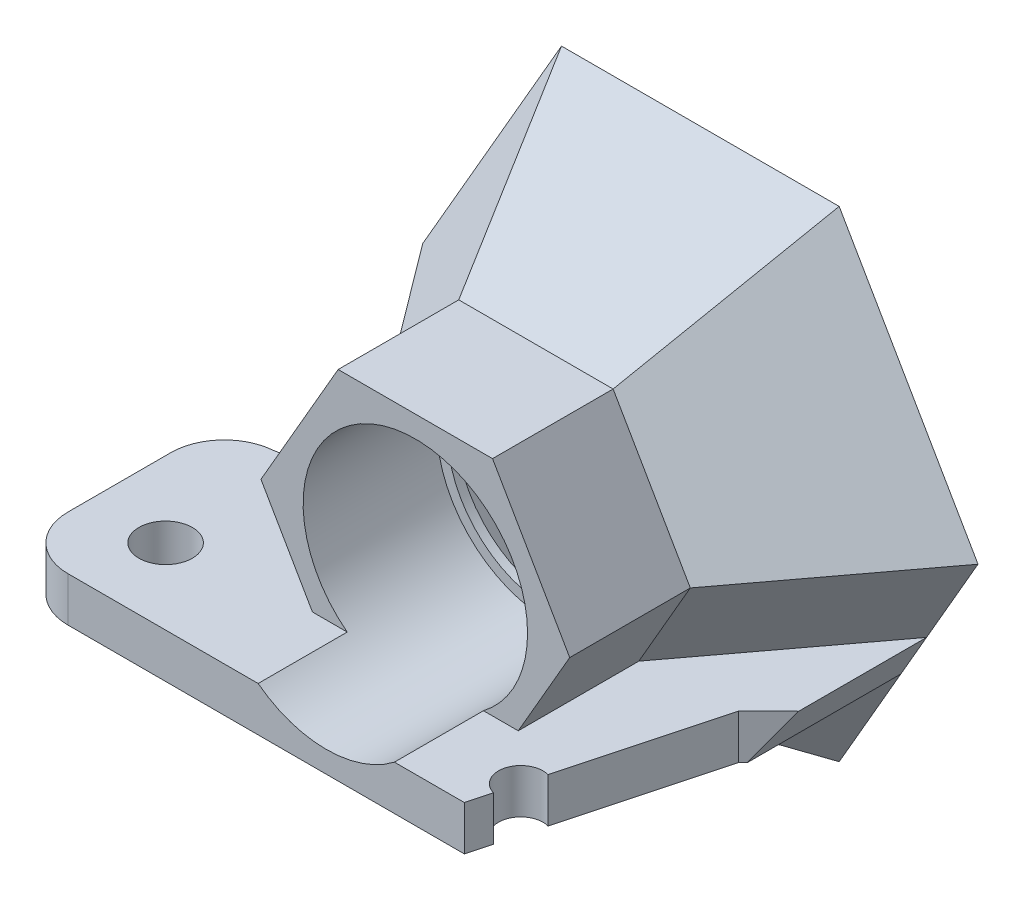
ISO-10303-21;
HEADER;
FILE_DESCRIPTION(('STEP AP214'),'2;1');
FILE_NAME('part.step','',(''),(''),'','','');
FILE_SCHEMA(('AUTOMOTIVE_DESIGN { 1 0 10303 214 1 1 1 1 }'));
ENDSEC;
DATA;
#1=APPLICATION_CONTEXT('core data for automotive mechanical design processes');
#2=APPLICATION_PROTOCOL_DEFINITION('international standard','automotive_design',2000,#1);
#3=PRODUCT_CONTEXT('',#1,'mechanical');
#4=PRODUCT('Part','Part','',(#3));
#5=PRODUCT_RELATED_PRODUCT_CATEGORY('part','',(#4));
#6=PRODUCT_DEFINITION_FORMATION('','',#4);
#7=PRODUCT_DEFINITION_CONTEXT('part definition',#1,'design');
#8=PRODUCT_DEFINITION('design','',#6,#7);
#9=PRODUCT_DEFINITION_SHAPE('','',#8);
#10=(LENGTH_UNIT() NAMED_UNIT(*) SI_UNIT(.MILLI.,.METRE.));
#11=(NAMED_UNIT(*) PLANE_ANGLE_UNIT() SI_UNIT($,.RADIAN.));
#12=(NAMED_UNIT(*) SI_UNIT($,.STERADIAN.) SOLID_ANGLE_UNIT());
#13=UNCERTAINTY_MEASURE_WITH_UNIT(LENGTH_MEASURE(1.E-05),#10,'distance_accuracy_value','');
#14=(GEOMETRIC_REPRESENTATION_CONTEXT(3) GLOBAL_UNCERTAINTY_ASSIGNED_CONTEXT((#13)) GLOBAL_UNIT_ASSIGNED_CONTEXT((#10,
#11,#12)) REPRESENTATION_CONTEXT('',''));
#15=CARTESIAN_POINT('',(0.,0.,0.));
#16=DIRECTION('',(0.,0.,1.));
#17=DIRECTION('',(1.,0.,0.));
#18=AXIS2_PLACEMENT_3D('',#15,#16,#17);
#19=CARTESIAN_POINT('',(7.75,-15.0059240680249,21.));
#20=DIRECTION('',(-0.965925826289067,0.,-0.258819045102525));
#21=DIRECTION('',(-0.258819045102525,0.,0.965925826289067));
#22=AXIS2_PLACEMENT_3D('',#19,#20,#21);
#23=PLANE('',#22);
#24=DIRECTION('',(0.258819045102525,0.,-0.965925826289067));
#25=VECTOR('',#24,1.);
#26=CARTESIAN_POINT('',(125012.190555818,-7.50592406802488,-466501.923326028));
#27=LINE('',#26,#25);
#28=CARTESIAN_POINT('',(7.75,-7.50592406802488,21.));
#29=VERTEX_POINT('',#28);
#30=CARTESIAN_POINT('',(8.09634917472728,-7.50592406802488,19.7074072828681));
#31=VERTEX_POINT('',#30);
#32=EDGE_CURVE('E295',#29,#31,#27,.T.);
#33=ORIENTED_EDGE('',*,*,#32,.T.);
#34=DIRECTION('',(0.,1.,0.));
#35=VECTOR('',#34,1.);
#36=CARTESIAN_POINT('',(8.09634917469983,-15.0059240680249,19.7074072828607));
#37=LINE('',#36,#35);
#38=CARTESIAN_POINT('',(8.09634917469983,-5.00592406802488,19.7074072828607));
#39=VERTEX_POINT('',#38);
#40=EDGE_CURVE('E279',#31,#39,#37,.T.);
#41=ORIENTED_EDGE('',*,*,#40,.T.);
#42=DIRECTION('',(-0.258819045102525,0.,0.965925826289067));
#43=VECTOR('',#42,1.);
#44=CARTESIAN_POINT('',(7.75,-5.00592406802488,21.));
#45=LINE('',#44,#43);
#46=CARTESIAN_POINT('',(7.75,-5.00592406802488,21.));
#47=VERTEX_POINT('',#46);
#48=EDGE_CURVE('E292',#39,#47,#45,.T.);
#49=ORIENTED_EDGE('',*,*,#48,.T.);
#50=DIRECTION('',(0.,-1.,0.));
#51=VECTOR('',#50,1.);
#52=CARTESIAN_POINT('',(7.75,0.,21.));
#53=LINE('',#52,#51);
#54=EDGE_CURVE('E374',#47,#29,#53,.T.);
#55=ORIENTED_EDGE('',*,*,#54,.T.);
#56=EDGE_LOOP('',(#33,#41,#49,#55));
#57=FACE_BOUND('',#56,.T.);
#58=ADVANCED_FACE('F47',(#57),#23,.F.);
#59=CARTESIAN_POINT('',(11.2549099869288,-7.50592406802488,-500000.));
#60=DIRECTION('',(0.866025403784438,-0.500000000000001,0.));
#61=DIRECTION('',(0.500000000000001,0.866025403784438,0.));
#62=AXIS2_PLACEMENT_3D('',#59,#60,#61);
#63=PLANE('',#62);
#64=DIRECTION('',(0.447213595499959,0.774596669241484,-0.447213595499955));
#65=VECTOR('',#64,1.);
#66=CARTESIAN_POINT('',(100012.978094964,173200.559476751,-99993.1072600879));
#67=LINE('',#66,#65);
#68=CARTESIAN_POINT('',(11.2549099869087,-7.50592406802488,8.61592488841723));
#69=VERTEX_POINT('',#68);
#70=CARTESIAN_POINT('',(12.6630501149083,-5.06695382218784,7.20778476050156));
#71=VERTEX_POINT('',#70);
#72=EDGE_CURVE('E320',#69,#71,#67,.T.);
#73=ORIENTED_EDGE('',*,*,#72,.F.);
#74=DIRECTION('',(0.,0.,1.));
#75=VECTOR('',#74,1.);
#76=CARTESIAN_POINT('',(11.2549099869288,-7.50592406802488,-500000.));
#77=LINE('',#76,#75);
#78=CARTESIAN_POINT('',(11.2549099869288,-7.50592406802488,5.6843418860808E-11));
#79=VERTEX_POINT('',#78);
#80=EDGE_CURVE('E435',#79,#69,#77,.T.);
#81=ORIENTED_EDGE('',*,*,#80,.F.);
#82=DIRECTION('',(-0.500000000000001,-0.866025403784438,0.));
#83=VECTOR('',#82,1.);
#84=CARTESIAN_POINT('',(11.2549099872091,-7.50592406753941,5.6843418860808E-11));
#85=LINE('',#84,#83);
#86=CARTESIAN_POINT('',(12.6982856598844,-5.00592406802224,1.70530256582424E-10));
#87=VERTEX_POINT('',#86);
#88=EDGE_CURVE('E429',#79,#87,#85,.F.);
#89=ORIENTED_EDGE('',*,*,#88,.T.);
#90=DIRECTION('',(0.,0.,1.));
#91=VECTOR('',#90,1.);
#92=CARTESIAN_POINT('',(12.6982856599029,-5.00592406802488,-500000.));
#93=LINE('',#92,#91);
#94=CARTESIAN_POINT('',(12.6982856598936,-5.00592406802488,7.20778476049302));
#95=VERTEX_POINT('',#94);
#96=EDGE_CURVE('E432',#87,#95,#93,.T.);
#97=ORIENTED_EDGE('',*,*,#96,.T.);
#98=DIRECTION('',(0.500000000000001,0.866025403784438,0.));
#99=VECTOR('',#98,1.);
#100=CARTESIAN_POINT('',(11.254909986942,-7.50592406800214,7.20778476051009));
#101=LINE('',#100,#99);
#102=EDGE_CURVE('E316',#71,#95,#101,.T.);
#103=ORIENTED_EDGE('',*,*,#102,.F.);
#104=EDGE_LOOP('',(#73,#81,#89,#97,#103));
#105=FACE_BOUND('',#104,.T.);
#106=ADVANCED_FACE('F354',(#105),#63,.T.);
#107=CARTESIAN_POINT('',(-11.2549099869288,-7.50592406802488,-500000.));
#108=DIRECTION('',(-0.866025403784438,-0.500000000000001,0.));
#109=DIRECTION('',(0.500000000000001,-0.866025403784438,0.));
#110=AXIS2_PLACEMENT_3D('',#107,#108,#109);
#111=PLANE('',#110);
#112=DIRECTION('',(0.,0.,1.));
#113=VECTOR('',#112,1.);
#114=CARTESIAN_POINT('',(-11.2549099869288,-7.50592406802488,-500000.));
#115=LINE('',#114,#113);
#116=CARTESIAN_POINT('',(-11.2549099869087,-7.50592406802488,5.6843418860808E-11));
#117=VERTEX_POINT('',#116);
#118=CARTESIAN_POINT('',(-11.2549099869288,-7.50592406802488,7.23006751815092));
#119=VERTEX_POINT('',#118);
#120=EDGE_CURVE('E420',#117,#119,#115,.T.);
#121=ORIENTED_EDGE('',*,*,#120,.T.);
#122=DIRECTION('',(-0.500000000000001,0.866025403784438,0.));
#123=VECTOR('',#122,1.);
#124=CARTESIAN_POINT('',(-11.2549099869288,-7.50592406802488,7.23006751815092));
#125=LINE('',#124,#123);
#126=CARTESIAN_POINT('',(-12.6982856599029,-5.00592406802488,7.23006751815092));
#127=VERTEX_POINT('',#126);
#128=EDGE_CURVE('E606',#119,#127,#125,.T.);
#129=ORIENTED_EDGE('',*,*,#128,.T.);
#130=DIRECTION('',(0.,0.,1.));
#131=VECTOR('',#130,1.);
#132=CARTESIAN_POINT('',(-12.6982856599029,-5.00592406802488,-500000.));
#133=LINE('',#132,#131);
#134=CARTESIAN_POINT('',(-12.6982856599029,-5.00592406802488,5.6843418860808E-11));
#135=VERTEX_POINT('',#134);
#136=EDGE_CURVE('E414',#135,#127,#133,.T.);
#137=ORIENTED_EDGE('',*,*,#136,.F.);
#138=DIRECTION('',(-0.500000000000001,0.866025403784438,0.));
#139=VECTOR('',#138,1.);
#140=CARTESIAN_POINT('',(-11.2549099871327,-7.50592406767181,5.6843418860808E-11));
#141=LINE('',#140,#139);
#142=EDGE_CURVE('E413',#135,#117,#141,.F.);
#143=ORIENTED_EDGE('',*,*,#142,.T.);
#144=EDGE_LOOP('',(#121,#129,#137,#143));
#145=FACE_BOUND('',#144,.T.);
#146=ADVANCED_FACE('F348',(#145),#111,.T.);
#147=CARTESIAN_POINT('',(-15.5884572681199,0.,0.));
#148=DIRECTION('',(-0.72631001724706,-0.419335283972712,0.544639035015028));
#149=DIRECTION('',(0.599934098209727,0.,0.800049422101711));
#150=AXIS2_PLACEMENT_3D('',#147,#148,#149);
#151=PLANE('',#150);
#152=DIRECTION('',(-0.299967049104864,-0.519558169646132,-0.800049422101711));
#153=VECTOR('',#152,1.);
#154=CARTESIAN_POINT('',(-7.79422863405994,-13.5,0.));
#155=LINE('',#154,#153);
#156=CARTESIAN_POINT('',(-4.33354728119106,-7.50592406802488,9.23006751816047));
#157=VERTEX_POINT('',#156);
#158=CARTESIAN_POINT('',(-7.79422863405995,-13.5,0.));
#159=VERTEX_POINT('',#158);
#160=EDGE_CURVE('E565',#157,#159,#155,.T.);
#161=ORIENTED_EDGE('',*,*,#160,.F.);
#162=DIRECTION('',(-0.599934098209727,0.,-0.800049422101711));
#163=VECTOR('',#162,1.);
#164=CARTESIAN_POINT('',(-239997.228052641,-7.50592406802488,-320036.216808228));
#165=LINE('',#164,#163);
#166=EDGE_CURVE('E411',#117,#157,#165,.F.);
#167=ORIENTED_EDGE('',*,*,#166,.F.);
#168=DIRECTION('',(0.5,-0.866025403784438,0.));
#169=VECTOR('',#168,1.);
#170=CARTESIAN_POINT('',(-15.5884572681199,0.,0.));
#171=LINE('',#170,#169);
#172=EDGE_CURVE('E545',#117,#159,#171,.T.);
#173=ORIENTED_EDGE('',*,*,#172,.T.);
#174=EDGE_LOOP('',(#161,#167,#173));
#175=FACE_BOUND('',#174,.T.);
#176=ADVANCED_FACE('F353',(#175),#151,.T.);
#177=CARTESIAN_POINT('',(7.79422863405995,-13.5,0.));
#178=DIRECTION('',(0.72631001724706,-0.419335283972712,0.544639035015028));
#179=DIRECTION('',(0.599934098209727,0.,-0.800049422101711));
#180=AXIS2_PLACEMENT_3D('',#177,#178,#179);
#181=PLANE('',#180);
#182=DIRECTION('',(-0.5,-0.866025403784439,0.));
#183=VECTOR('',#182,1.);
#184=CARTESIAN_POINT('',(4.33354728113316,-7.50592406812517,9.23006751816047));
#185=LINE('',#184,#183);
#186=CARTESIAN_POINT('',(5.77692295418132,-5.00592406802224,9.23006751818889));
#187=VERTEX_POINT('',#186);
#188=CARTESIAN_POINT('',(8.66709456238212,0.,9.23006751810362));
#189=VERTEX_POINT('',#188);
#190=EDGE_CURVE('E474',#187,#189,#185,.F.);
#191=ORIENTED_EDGE('',*,*,#190,.F.);
#192=DIRECTION('',(0.599934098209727,0.,-0.800049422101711));
#193=VECTOR('',#192,1.);
#194=CARTESIAN_POINT('',(240001.162571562,-5.0059240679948,-320039.538902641));
#195=LINE('',#194,#193);
#196=EDGE_CURVE('E438',#87,#187,#195,.F.);
#197=ORIENTED_EDGE('',*,*,#196,.F.);
#198=DIRECTION('',(0.5,0.866025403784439,0.));
#199=VECTOR('',#198,1.);
#200=CARTESIAN_POINT('',(7.79422863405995,-13.5,0.));
#201=LINE('',#200,#199);
#202=CARTESIAN_POINT('',(15.5884572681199,0.,0.));
#203=VERTEX_POINT('',#202);
#204=EDGE_CURVE('E552',#87,#203,#201,.T.);
#205=ORIENTED_EDGE('',*,*,#204,.T.);
#206=DIRECTION('',(0.599934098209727,0.,-0.800049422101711));
#207=VECTOR('',#206,1.);
#208=CARTESIAN_POINT('',(15.5884572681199,0.,0.));
#209=LINE('',#208,#207);
#210=EDGE_CURVE('E556',#189,#203,#209,.T.);
#211=ORIENTED_EDGE('',*,*,#210,.F.);
#212=EDGE_LOOP('',(#191,#197,#205,#211));
#213=FACE_BOUND('',#212,.T.);
#214=ADVANCED_FACE('F652',(#213),#181,.T.);
#215=CARTESIAN_POINT('',(15.5884572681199,0.,0.));
#216=DIRECTION('',(0.72631001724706,0.419335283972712,0.544639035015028));
#217=DIRECTION('',(0.599934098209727,0.,-0.800049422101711));
#218=AXIS2_PLACEMENT_3D('',#215,#216,#217);
#219=PLANE('',#218);
#220=DIRECTION('',(0.299967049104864,0.519558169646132,-0.800049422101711));
#221=VECTOR('',#220,1.);
#222=CARTESIAN_POINT('',(7.79422863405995,13.5,0.));
#223=LINE('',#222,#221);
#224=CARTESIAN_POINT('',(4.33354728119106,7.50592406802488,9.23006751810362));
#225=VERTEX_POINT('',#224);
#226=CARTESIAN_POINT('',(7.79422863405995,13.5,0.));
#227=VERTEX_POINT('',#226);
#228=EDGE_CURVE('E557',#225,#227,#223,.T.);
#229=ORIENTED_EDGE('',*,*,#228,.F.);
#230=DIRECTION('',(0.5,-0.866025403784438,0.));
#231=VECTOR('',#230,1.);
#232=CARTESIAN_POINT('',(8.66709456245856,-1.32398094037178E-10,9.23006751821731));
#233=LINE('',#232,#231);
#234=EDGE_CURVE('E477',#189,#225,#233,.F.);
#235=ORIENTED_EDGE('',*,*,#234,.F.);
#236=ORIENTED_EDGE('',*,*,#210,.T.);
#237=DIRECTION('',(-0.5,0.866025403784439,0.));
#238=VECTOR('',#237,1.);
#239=CARTESIAN_POINT('',(15.5884572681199,0.,0.));
#240=LINE('',#239,#238);
#241=EDGE_CURVE('E509',#203,#227,#240,.T.);
#242=ORIENTED_EDGE('',*,*,#241,.T.);
#243=EDGE_LOOP('',(#229,#235,#236,#242));
#244=FACE_BOUND('',#243,.T.);
#245=ADVANCED_FACE('F647',(#244),#219,.T.);
#246=CARTESIAN_POINT('',(7.79422863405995,13.5,0.));
#247=DIRECTION('',(0.,0.838670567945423,0.544639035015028));
#248=DIRECTION('',(0.,-0.544639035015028,0.838670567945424));
#249=AXIS2_PLACEMENT_3D('',#246,#247,#248);
#250=PLANE('',#249);
#251=DIRECTION('',(-0.299967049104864,0.519558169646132,-0.800049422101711));
#252=VECTOR('',#251,1.);
#253=CARTESIAN_POINT('',(-7.79422863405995,13.5,0.));
#254=LINE('',#253,#252);
#255=CARTESIAN_POINT('',(-4.33354728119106,7.50592406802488,9.23006751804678));
#256=VERTEX_POINT('',#255);
#257=CARTESIAN_POINT('',(-7.79422863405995,13.5,0.));
#258=VERTEX_POINT('',#257);
#259=EDGE_CURVE('E560',#256,#258,#254,.T.);
#260=ORIENTED_EDGE('',*,*,#259,.F.);
#261=DIRECTION('',(1.,0.,0.));
#262=VECTOR('',#261,1.);
#263=CARTESIAN_POINT('',(4.33354728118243,7.50592406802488,9.23006751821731));
#264=LINE('',#263,#262);
#265=EDGE_CURVE('E487',#225,#256,#264,.F.);
#266=ORIENTED_EDGE('',*,*,#265,.F.);
#267=ORIENTED_EDGE('',*,*,#228,.T.);
#268=DIRECTION('',(-1.,0.,0.));
#269=VECTOR('',#268,1.);
#270=CARTESIAN_POINT('',(7.79422863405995,13.5,0.));
#271=LINE('',#270,#269);
#272=EDGE_CURVE('E539',#227,#258,#271,.T.);
#273=ORIENTED_EDGE('',*,*,#272,.T.);
#274=EDGE_LOOP('',(#260,#266,#267,#273));
#275=FACE_BOUND('',#274,.T.);
#276=ADVANCED_FACE('F49',(#275),#250,.T.);
#277=CARTESIAN_POINT('',(-7.79422863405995,13.5,0.));
#278=DIRECTION('',(-0.72631001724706,0.419335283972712,0.544639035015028));
#279=DIRECTION('',(0.599934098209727,0.,0.800049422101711));
#280=AXIS2_PLACEMENT_3D('',#277,#278,#279);
#281=PLANE('',#280);
#282=DIRECTION('',(-0.599934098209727,0.,-0.800049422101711));
#283=VECTOR('',#282,1.);
#284=CARTESIAN_POINT('',(-15.5884572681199,0.,0.));
#285=LINE('',#284,#283);
#286=CARTESIAN_POINT('',(-8.66709456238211,0.,9.23006751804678));
#287=VERTEX_POINT('',#286);
#288=CARTESIAN_POINT('',(-15.5884572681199,0.,0.));
#289=VERTEX_POINT('',#288);
#290=EDGE_CURVE('E568',#287,#289,#285,.T.);
#291=ORIENTED_EDGE('',*,*,#290,.F.);
#292=DIRECTION('',(0.5,0.866025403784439,0.));
#293=VECTOR('',#292,1.);
#294=CARTESIAN_POINT('',(-4.33354728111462,7.50592406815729,9.23006751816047));
#295=LINE('',#294,#293);
#296=EDGE_CURVE('E485',#256,#287,#295,.F.);
#297=ORIENTED_EDGE('',*,*,#296,.F.);
#298=ORIENTED_EDGE('',*,*,#259,.T.);
#299=DIRECTION('',(-0.5,-0.866025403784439,0.));
#300=VECTOR('',#299,1.);
#301=CARTESIAN_POINT('',(-7.79422863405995,13.5,0.));
#302=LINE('',#301,#300);
#303=EDGE_CURVE('E542',#258,#289,#302,.T.);
#304=ORIENTED_EDGE('',*,*,#303,.T.);
#305=EDGE_LOOP('',(#291,#297,#298,#304));
#306=FACE_BOUND('',#305,.T.);
#307=ADVANCED_FACE('F640',(#306),#281,.T.);
#308=EDGE_CURVE('E546',#289,#135,#171,.T.);
#309=ORIENTED_EDGE('',*,*,#308,.T.);
#310=DIRECTION('',(0.599934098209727,0.,0.800049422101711));
#311=VECTOR('',#310,1.);
#312=CARTESIAN_POINT('',(-240001.162571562,-5.0059240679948,-320039.538902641));
#313=LINE('',#312,#311);
#314=CARTESIAN_POINT('',(-5.77692295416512,-5.00592406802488,9.23006751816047));
#315=VERTEX_POINT('',#314);
#316=EDGE_CURVE('E415',#315,#135,#313,.F.);
#317=ORIENTED_EDGE('',*,*,#316,.F.);
#318=DIRECTION('',(-0.5,0.866025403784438,0.));
#319=VECTOR('',#318,1.);
#320=CARTESIAN_POINT('',(-8.66709456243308,8.82728235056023E-11,9.23006751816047));
#321=LINE('',#320,#319);
#322=EDGE_CURVE('E481',#287,#315,#321,.F.);
#323=ORIENTED_EDGE('',*,*,#322,.F.);
#324=ORIENTED_EDGE('',*,*,#290,.T.);
#325=EDGE_LOOP('',(#309,#317,#323,#324));
#326=FACE_BOUND('',#325,.T.);
#327=ADVANCED_FACE('F635',(#326),#151,.T.);
#328=CARTESIAN_POINT('',(-7.79422863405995,-13.5,0.));
#329=DIRECTION('',(0.,-0.838670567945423,0.544639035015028));
#330=DIRECTION('',(0.,-0.544639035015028,-0.838670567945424));
#331=AXIS2_PLACEMENT_3D('',#328,#329,#330);
#332=PLANE('',#331);
#333=DIRECTION('',(0.299967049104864,-0.519558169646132,-0.800049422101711));
#334=VECTOR('',#333,1.);
#335=CARTESIAN_POINT('',(7.79422863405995,-13.5,0.));
#336=LINE('',#335,#334);
#337=CARTESIAN_POINT('',(4.33354728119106,-7.50592406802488,9.23006751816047));
#338=VERTEX_POINT('',#337);
#339=CARTESIAN_POINT('',(7.79422863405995,-13.5,0.));
#340=VERTEX_POINT('',#339);
#341=EDGE_CURVE('E563',#338,#340,#336,.T.);
#342=ORIENTED_EDGE('',*,*,#341,.F.);
#343=DIRECTION('',(-1.,0.,0.));
#344=VECTOR('',#343,1.);
#345=CARTESIAN_POINT('',(-4.33354728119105,-7.50592406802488,9.23006751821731));
#346=LINE('',#345,#344);
#347=EDGE_CURVE('E478',#157,#338,#346,.F.);
#348=ORIENTED_EDGE('',*,*,#347,.F.);
#349=ORIENTED_EDGE('',*,*,#160,.T.);
#350=DIRECTION('',(1.,0.,0.));
#351=VECTOR('',#350,1.);
#352=CARTESIAN_POINT('',(-7.79422863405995,-13.5,0.));
#353=LINE('',#352,#351);
#354=EDGE_CURVE('E549',#159,#340,#353,.T.);
#355=ORIENTED_EDGE('',*,*,#354,.T.);
#356=EDGE_LOOP('',(#342,#348,#349,#355));
#357=FACE_BOUND('',#356,.T.);
#358=ADVANCED_FACE('F664',(#357),#332,.T.);
#359=EDGE_CURVE('E553',#340,#79,#201,.T.);
#360=ORIENTED_EDGE('',*,*,#359,.T.);
#361=DIRECTION('',(-0.599934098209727,0.,0.800049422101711));
#362=VECTOR('',#361,1.);
#363=CARTESIAN_POINT('',(239997.228052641,-7.50592406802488,-320036.216808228));
#364=LINE('',#363,#362);
#365=EDGE_CURVE('E426',#338,#79,#364,.F.);
#366=ORIENTED_EDGE('',*,*,#365,.F.);
#367=ORIENTED_EDGE('',*,*,#341,.T.);
#368=EDGE_LOOP('',(#360,#366,#367));
#369=FACE_BOUND('',#368,.T.);
#370=ADVANCED_FACE('F660',(#369),#181,.T.);
#371=CARTESIAN_POINT('',(0.,27.,0.));
#372=DIRECTION('',(0.,0.,1.));
#373=DIRECTION('',(1.,0.,0.));
#374=AXIS2_PLACEMENT_3D('',#371,#372,#373);
#375=PLANE('',#374);
#376=DIRECTION('',(-1.,0.,0.));
#377=VECTOR('',#376,1.);
#378=CARTESIAN_POINT('',(6.41740609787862,-12.4726626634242,0.));
#379=LINE('',#378,#377);
#380=CARTESIAN_POINT('',(-7.20109514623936,-12.4726626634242,0.));
#381=VERTEX_POINT('',#380);
#382=CARTESIAN_POINT('',(7.20109514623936,-12.4726626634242,0.));
#383=VERTEX_POINT('',#382);
#384=EDGE_CURVE('E578',#381,#383,#379,.F.);
#385=ORIENTED_EDGE('',*,*,#384,.T.);
#386=DIRECTION('',(-0.5,-0.866025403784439,0.));
#387=VECTOR('',#386,1.);
#388=CARTESIAN_POINT('',(14.0103457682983,-0.678694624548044,0.));
#389=LINE('',#388,#387);
#390=CARTESIAN_POINT('',(14.4021902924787,0.,0.));
#391=VERTEX_POINT('',#390);
#392=EDGE_CURVE('E580',#383,#391,#389,.F.);
#393=ORIENTED_EDGE('',*,*,#392,.T.);
#394=DIRECTION('',(0.5,-0.866025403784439,0.));
#395=VECTOR('',#394,1.);
#396=CARTESIAN_POINT('',(7.59293967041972,11.7939680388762,0.));
#397=LINE('',#396,#395);
#398=CARTESIAN_POINT('',(7.20109514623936,12.4726626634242,0.));
#399=VERTEX_POINT('',#398);
#400=EDGE_CURVE('E559',#391,#399,#397,.F.);
#401=ORIENTED_EDGE('',*,*,#400,.T.);
#402=DIRECTION('',(1.,0.,0.));
#403=VECTOR('',#402,1.);
#404=CARTESIAN_POINT('',(-6.41740609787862,12.4726626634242,0.));
#405=LINE('',#404,#403);
#406=CARTESIAN_POINT('',(-7.20109514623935,12.4726626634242,0.));
#407=VERTEX_POINT('',#406);
#408=EDGE_CURVE('E572',#399,#407,#405,.F.);
#409=ORIENTED_EDGE('',*,*,#408,.T.);
#410=DIRECTION('',(0.5,0.866025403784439,0.));
#411=VECTOR('',#410,1.);
#412=CARTESIAN_POINT('',(-14.0103457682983,0.678694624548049,0.));
#413=LINE('',#412,#411);
#414=CARTESIAN_POINT('',(-14.4021902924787,0.,0.));
#415=VERTEX_POINT('',#414);
#416=EDGE_CURVE('E574',#407,#415,#413,.F.);
#417=ORIENTED_EDGE('',*,*,#416,.T.);
#418=DIRECTION('',(-0.5,0.866025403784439,0.));
#419=VECTOR('',#418,1.);
#420=CARTESIAN_POINT('',(-7.59293967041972,-11.7939680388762,0.));
#421=LINE('',#420,#419);
#422=EDGE_CURVE('E576',#415,#381,#421,.F.);
#423=ORIENTED_EDGE('',*,*,#422,.T.);
#424=EDGE_LOOP('',(#385,#393,#401,#409,#417,#423));
#425=FACE_BOUND('',#424,.T.);
#426=ORIENTED_EDGE('',*,*,#241,.F.);
#427=ORIENTED_EDGE('',*,*,#204,.F.);
#428=ORIENTED_EDGE('',*,*,#88,.F.);
#429=ORIENTED_EDGE('',*,*,#359,.F.);
#430=ORIENTED_EDGE('',*,*,#354,.F.);
#431=ORIENTED_EDGE('',*,*,#172,.F.);
#432=ORIENTED_EDGE('',*,*,#142,.F.);
#433=ORIENTED_EDGE('',*,*,#308,.F.);
#434=ORIENTED_EDGE('',*,*,#303,.F.);
#435=ORIENTED_EDGE('',*,*,#272,.F.);
#436=EDGE_LOOP('',(#426,#427,#428,#429,#430,#431,#432,#433,#434,#435));
#437=FACE_BOUND('',#436,.T.);
#438=ADVANCED_FACE('F630',(#425,#437),#375,.F.);
#439=CARTESIAN_POINT('',(14.1358372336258,-0.838670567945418,-1.08927807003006));
#440=DIRECTION('',(0.72631001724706,0.419335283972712,0.544639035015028));
#441=DIRECTION('',(0.599934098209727,0.,-0.800049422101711));
#442=AXIS2_PLACEMENT_3D('',#439,#440,#441);
#443=PLANE('',#442);
#444=DIRECTION('',(0.299967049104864,0.519558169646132,-0.800049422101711));
#445=VECTOR('',#444,1.);
#446=CARTESIAN_POINT('',(6.91295333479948,11.9735864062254,-1.32168610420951));
#447=LINE('',#446,#445);
#448=CARTESIAN_POINT('',(3.41792090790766,5.92001266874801,8.));
#449=VERTEX_POINT('',#448);
#450=CARTESIAN_POINT('',(5.99057845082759,10.3759862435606,1.13840241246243));
#451=VERTEX_POINT('',#450);
#452=EDGE_CURVE('E506',#449,#451,#447,.T.);
#453=ORIENTED_EDGE('',*,*,#452,.T.);
#454=DIRECTION('',(-0.5,0.866025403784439,0.));
#455=VECTOR('',#454,1.);
#456=CARTESIAN_POINT('',(12.1945707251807,-0.369643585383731,1.13840241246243));
#457=LINE('',#456,#455);
#458=CARTESIAN_POINT('',(11.9811569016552,0.,1.13840241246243));
#459=VERTEX_POINT('',#458);
#460=EDGE_CURVE('E594',#451,#459,#457,.F.);
#461=ORIENTED_EDGE('',*,*,#460,.T.);
#462=DIRECTION('',(0.599934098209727,0.,-0.800049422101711));
#463=VECTOR('',#462,1.);
#464=CARTESIAN_POINT('',(13.825906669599,0.,-1.32168610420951));
#465=LINE('',#464,#463);
#466=CARTESIAN_POINT('',(6.83584181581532,0.,8.));
#467=VERTEX_POINT('',#466);
#468=EDGE_CURVE('E514',#467,#459,#465,.T.);
#469=ORIENTED_EDGE('',*,*,#468,.F.);
#470=DIRECTION('',(0.5,-0.866025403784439,0.));
#471=VECTOR('',#470,1.);
#472=CARTESIAN_POINT('',(9.02399567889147,-3.78999366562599,8.));
#473=LINE('',#472,#471);
#474=EDGE_CURVE('E505',#467,#449,#473,.F.);
#475=ORIENTED_EDGE('',*,*,#474,.T.);
#476=EDGE_LOOP('',(#453,#461,#469,#475));
#477=FACE_BOUND('',#476,.T.);
#478=ADVANCED_FACE('F765',(#477),#443,.F.);
#479=CARTESIAN_POINT('',(7.79422863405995,11.8226588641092,-1.08927807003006));
#480=DIRECTION('',(0.,0.838670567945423,0.544639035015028));
#481=DIRECTION('',(0.,-0.544639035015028,0.838670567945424));
#482=AXIS2_PLACEMENT_3D('',#479,#480,#481);
#483=PLANE('',#482);
#484=DIRECTION('',(-0.299967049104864,0.519558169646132,-0.800049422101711));
#485=VECTOR('',#484,1.);
#486=CARTESIAN_POINT('',(-6.91295333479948,11.9735864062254,-1.32168610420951));
#487=LINE('',#486,#485);
#488=CARTESIAN_POINT('',(-3.41792090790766,5.92001266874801,8.));
#489=VERTEX_POINT('',#488);
#490=CARTESIAN_POINT('',(-5.99057845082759,10.3759862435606,1.13840241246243));
#491=VERTEX_POINT('',#490);
#492=EDGE_CURVE('E510',#489,#491,#487,.T.);
#493=ORIENTED_EDGE('',*,*,#492,.T.);
#494=DIRECTION('',(-1.,0.,0.));
#495=VECTOR('',#494,1.);
#496=CARTESIAN_POINT('',(6.41740609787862,10.3759862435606,1.13840241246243));
#497=LINE('',#496,#495);
#498=EDGE_CURVE('E592',#491,#451,#497,.F.);
#499=ORIENTED_EDGE('',*,*,#498,.T.);
#500=ORIENTED_EDGE('',*,*,#452,.F.);
#501=DIRECTION('',(1.,0.,0.));
#502=VECTOR('',#501,1.);
#503=CARTESIAN_POINT('',(7.79422863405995,5.92001266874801,8.));
#504=LINE('',#503,#502);
#505=EDGE_CURVE('E513',#449,#489,#504,.F.);
#506=ORIENTED_EDGE('',*,*,#505,.T.);
#507=EDGE_LOOP('',(#493,#499,#500,#506));
#508=FACE_BOUND('',#507,.T.);
#509=ADVANCED_FACE('F768',(#508),#483,.F.);
#510=CARTESIAN_POINT('',(-6.34160859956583,12.6613294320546,-1.08927807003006));
#511=DIRECTION('',(-0.72631001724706,0.419335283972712,0.544639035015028));
#512=DIRECTION('',(0.599934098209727,0.,0.800049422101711));
#513=AXIS2_PLACEMENT_3D('',#510,#511,#512);
#514=PLANE('',#513);
#515=DIRECTION('',(-0.599934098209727,0.,-0.800049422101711));
#516=VECTOR('',#515,1.);
#517=CARTESIAN_POINT('',(-13.825906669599,0.,-1.32168610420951));
#518=LINE('',#517,#516);
#519=CARTESIAN_POINT('',(-6.83584181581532,0.,8.));
#520=VERTEX_POINT('',#519);
#521=CARTESIAN_POINT('',(-11.9811569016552,0.,1.13840241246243));
#522=VERTEX_POINT('',#521);
#523=EDGE_CURVE('E521',#520,#522,#518,.T.);
#524=ORIENTED_EDGE('',*,*,#523,.T.);
#525=DIRECTION('',(-0.5,-0.866025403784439,0.));
#526=VECTOR('',#525,1.);
#527=CARTESIAN_POINT('',(-5.77716462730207,10.7456298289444,1.13840241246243));
#528=LINE('',#527,#526);
#529=EDGE_CURVE('E590',#522,#491,#528,.F.);
#530=ORIENTED_EDGE('',*,*,#529,.T.);
#531=ORIENTED_EDGE('',*,*,#492,.F.);
#532=DIRECTION('',(0.5,0.866025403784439,0.));
#533=VECTOR('',#532,1.);
#534=CARTESIAN_POINT('',(-1.22976704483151,9.71000633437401,8.));
#535=LINE('',#534,#533);
#536=EDGE_CURVE('E523',#489,#520,#535,.F.);
#537=ORIENTED_EDGE('',*,*,#536,.T.);
#538=EDGE_LOOP('',(#524,#530,#531,#537));
#539=FACE_BOUND('',#538,.T.);
#540=ADVANCED_FACE('F772',(#539),#514,.F.);
#541=CARTESIAN_POINT('',(-14.1358372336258,0.838670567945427,-1.08927807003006));
#542=DIRECTION('',(-0.72631001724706,-0.419335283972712,0.544639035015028));
#543=DIRECTION('',(0.599934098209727,0.,0.800049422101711));
#544=AXIS2_PLACEMENT_3D('',#541,#542,#543);
#545=PLANE('',#544);
#546=DIRECTION('',(-0.299967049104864,-0.519558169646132,-0.800049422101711));
#547=VECTOR('',#546,1.);
#548=CARTESIAN_POINT('',(-6.91295333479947,-11.9735864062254,-1.32168610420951));
#549=LINE('',#548,#547);
#550=CARTESIAN_POINT('',(-3.41792090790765,-5.92001266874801,8.));
#551=VERTEX_POINT('',#550);
#552=CARTESIAN_POINT('',(-5.99057845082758,-10.3759862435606,1.13840241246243));
#553=VERTEX_POINT('',#552);
#554=EDGE_CURVE('E526',#551,#553,#549,.T.);
#555=ORIENTED_EDGE('',*,*,#554,.T.);
#556=DIRECTION('',(0.5,-0.866025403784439,0.));
#557=VECTOR('',#556,1.);
#558=CARTESIAN_POINT('',(-12.1945707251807,0.369643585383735,1.13840241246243));
#559=LINE('',#558,#557);
#560=EDGE_CURVE('E588',#553,#522,#559,.F.);
#561=ORIENTED_EDGE('',*,*,#560,.T.);
#562=ORIENTED_EDGE('',*,*,#523,.F.);
#563=DIRECTION('',(-0.5,0.866025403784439,0.));
#564=VECTOR('',#563,1.);
#565=CARTESIAN_POINT('',(-9.02399567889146,3.789993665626,8.));
#566=LINE('',#565,#564);
#567=EDGE_CURVE('E528',#520,#551,#566,.F.);
#568=ORIENTED_EDGE('',*,*,#567,.T.);
#569=EDGE_LOOP('',(#555,#561,#562,#568));
#570=FACE_BOUND('',#569,.T.);
#571=ADVANCED_FACE('F776',(#570),#545,.F.);
#572=CARTESIAN_POINT('',(-7.79422863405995,-11.8226588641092,-1.08927807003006));
#573=DIRECTION('',(0.,-0.838670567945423,0.544639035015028));
#574=DIRECTION('',(0.,-0.544639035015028,-0.838670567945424));
#575=AXIS2_PLACEMENT_3D('',#572,#573,#574);
#576=PLANE('',#575);
#577=DIRECTION('',(0.299967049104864,-0.519558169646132,-0.800049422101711));
#578=VECTOR('',#577,1.);
#579=CARTESIAN_POINT('',(6.91295333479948,-11.9735864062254,-1.32168610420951));
#580=LINE('',#579,#578);
#581=CARTESIAN_POINT('',(3.41792090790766,-5.92001266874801,8.));
#582=VERTEX_POINT('',#581);
#583=CARTESIAN_POINT('',(5.99057845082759,-10.3759862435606,1.13840241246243));
#584=VERTEX_POINT('',#583);
#585=EDGE_CURVE('E517',#582,#584,#580,.T.);
#586=ORIENTED_EDGE('',*,*,#585,.T.);
#587=DIRECTION('',(1.,0.,0.));
#588=VECTOR('',#587,1.);
#589=CARTESIAN_POINT('',(-6.41740609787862,-10.3759862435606,1.13840241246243));
#590=LINE('',#589,#588);
#591=EDGE_CURVE('E586',#584,#553,#590,.F.);
#592=ORIENTED_EDGE('',*,*,#591,.T.);
#593=ORIENTED_EDGE('',*,*,#554,.F.);
#594=DIRECTION('',(-1.,0.,0.));
#595=VECTOR('',#594,1.);
#596=CARTESIAN_POINT('',(-7.79422863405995,-5.92001266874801,8.));
#597=LINE('',#596,#595);
#598=EDGE_CURVE('E532',#551,#582,#597,.F.);
#599=ORIENTED_EDGE('',*,*,#598,.T.);
#600=EDGE_LOOP('',(#586,#592,#593,#599));
#601=FACE_BOUND('',#600,.T.);
#602=ADVANCED_FACE('F780',(#601),#576,.F.);
#603=CARTESIAN_POINT('',(6.34160859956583,-12.6613294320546,-1.08927807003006));
#604=DIRECTION('',(0.72631001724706,-0.419335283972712,0.544639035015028));
#605=DIRECTION('',(0.599934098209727,0.,-0.800049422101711));
#606=AXIS2_PLACEMENT_3D('',#603,#604,#605);
#607=PLANE('',#606);
#608=ORIENTED_EDGE('',*,*,#468,.T.);
#609=DIRECTION('',(0.5,0.866025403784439,0.));
#610=VECTOR('',#609,1.);
#611=CARTESIAN_POINT('',(5.77716462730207,-10.7456298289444,1.13840241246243));
#612=LINE('',#611,#610);
#613=EDGE_CURVE('E583',#459,#584,#612,.F.);
#614=ORIENTED_EDGE('',*,*,#613,.T.);
#615=ORIENTED_EDGE('',*,*,#585,.F.);
#616=DIRECTION('',(-0.5,-0.866025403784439,0.));
#617=VECTOR('',#616,1.);
#618=CARTESIAN_POINT('',(1.22976704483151,-9.710006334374,8.));
#619=LINE('',#618,#617);
#620=EDGE_CURVE('E518',#582,#467,#619,.F.);
#621=ORIENTED_EDGE('',*,*,#620,.T.);
#622=EDGE_LOOP('',(#608,#614,#615,#621));
#623=FACE_BOUND('',#622,.T.);
#624=ADVANCED_FACE('F784',(#623),#607,.F.);
#625=CARTESIAN_POINT('',(0.,27.,8.));
#626=DIRECTION('',(0.,0.,1.));
#627=DIRECTION('',(1.,0.,0.));
#628=AXIS2_PLACEMENT_3D('',#625,#626,#627);
#629=PLANE('',#628);
#630=CARTESIAN_POINT('',(0.,0.,8.));
#631=DIRECTION('',(0.,0.,1.));
#632=DIRECTION('',(1.,0.,0.));
#633=AXIS2_PLACEMENT_3D('',#630,#631,#632);
#634=CIRCLE('',#633,5.7);
#635=CARTESIAN_POINT('',(5.7,0.,8.));
#636=VERTEX_POINT('',#635);
#637=EDGE_CURVE('E499',#636,#636,#634,.T.);
#638=ORIENTED_EDGE('',*,*,#637,.T.);
#639=EDGE_LOOP('',(#638));
#640=FACE_BOUND('',#639,.T.);
#641=ORIENTED_EDGE('',*,*,#474,.F.);
#642=ORIENTED_EDGE('',*,*,#620,.F.);
#643=ORIENTED_EDGE('',*,*,#598,.F.);
#644=ORIENTED_EDGE('',*,*,#567,.F.);
#645=ORIENTED_EDGE('',*,*,#536,.F.);
#646=ORIENTED_EDGE('',*,*,#505,.F.);
#647=EDGE_LOOP('',(#641,#642,#643,#644,#645,#646));
#648=FACE_BOUND('',#647,.T.);
#649=ADVANCED_FACE('F763',(#640,#648),#629,.F.);
#650=CARTESIAN_POINT('',(0.,0.,8.5));
#651=DIRECTION('',(0.,0.,1.));
#652=DIRECTION('',(1.,0.,0.));
#653=AXIS2_PLACEMENT_3D('',#650,#651,#652);
#654=CYLINDRICAL_SURFACE('',#653,6.3);
#655=DIRECTION('',(0.,0.,1.));
#656=VECTOR('',#655,1.);
#657=CARTESIAN_POINT('',(3.82501297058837,-5.00592406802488,9.23006751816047));
#658=LINE('',#657,#656);
#659=CARTESIAN_POINT('',(3.82501297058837,-5.00592406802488,16.));
#660=VERTEX_POINT('',#659);
#661=CARTESIAN_POINT('',(3.82501297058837,-5.00592406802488,21.));
#662=VERTEX_POINT('',#661);
#663=EDGE_CURVE('E394',#660,#662,#658,.T.);
#664=ORIENTED_EDGE('',*,*,#663,.F.);
#665=CARTESIAN_POINT('',(0.,0.,16.));
#666=DIRECTION('',(0.,0.,1.));
#667=DIRECTION('',(1.,0.,0.));
#668=AXIS2_PLACEMENT_3D('',#665,#666,#667);
#669=CIRCLE('',#668,6.3);
#670=CARTESIAN_POINT('',(-3.82501297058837,-5.00592406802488,16.));
#671=VERTEX_POINT('',#670);
#672=EDGE_CURVE('E456',#660,#671,#669,.T.);
#673=ORIENTED_EDGE('',*,*,#672,.T.);
#674=DIRECTION('',(0.,0.,1.));
#675=VECTOR('',#674,1.);
#676=CARTESIAN_POINT('',(-3.82501297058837,-5.00592406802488,9.23006751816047));
#677=LINE('',#676,#675);
#678=CARTESIAN_POINT('',(-3.82501297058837,-5.00592406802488,21.));
#679=VERTEX_POINT('',#678);
#680=EDGE_CURVE('E404',#671,#679,#677,.T.);
#681=ORIENTED_EDGE('',*,*,#680,.T.);
#682=CARTESIAN_POINT('',(0.,0.,21.));
#683=DIRECTION('',(0.,0.,-1.));
#684=DIRECTION('',(1.,0.,0.));
#685=AXIS2_PLACEMENT_3D('',#682,#683,#684);
#686=CIRCLE('',#685,6.30000000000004);
#687=EDGE_CURVE('E396',#662,#679,#686,.T.);
#688=ORIENTED_EDGE('',*,*,#687,.F.);
#689=EDGE_LOOP('',(#664,#673,#681,#688));
#690=FACE_BOUND('',#689,.T.);
#691=CARTESIAN_POINT('',(0.,0.,8.5));
#692=DIRECTION('',(0.,0.,1.));
#693=DIRECTION('',(1.,0.,0.));
#694=AXIS2_PLACEMENT_3D('',#691,#692,#693);
#695=CIRCLE('',#694,6.3);
#696=CARTESIAN_POINT('',(6.3,0.,8.5));
#697=VERTEX_POINT('',#696);
#698=EDGE_CURVE('E502',#697,#697,#695,.T.);
#699=ORIENTED_EDGE('',*,*,#698,.F.);
#700=EDGE_LOOP('',(#699));
#701=FACE_BOUND('',#700,.T.);
#702=ADVANCED_FACE('F759',(#690,#701),#654,.F.);
#703=CARTESIAN_POINT('',(0.,0.,8.5));
#704=DIRECTION('',(0.,0.,1.));
#705=DIRECTION('',(1.,0.,0.));
#706=AXIS2_PLACEMENT_3D('',#703,#704,#705);
#707=PLANE('',#706);
#708=CARTESIAN_POINT('',(0.,0.,8.5));
#709=DIRECTION('',(0.,0.,1.));
#710=DIRECTION('',(1.,0.,0.));
#711=AXIS2_PLACEMENT_3D('',#708,#709,#710);
#712=CIRCLE('',#711,5.7);
#713=CARTESIAN_POINT('',(5.7,0.,8.5));
#714=VERTEX_POINT('',#713);
#715=EDGE_CURVE('E476',#714,#714,#712,.T.);
#716=ORIENTED_EDGE('',*,*,#715,.F.);
#717=EDGE_LOOP('',(#716));
#718=FACE_BOUND('',#717,.T.);
#719=ORIENTED_EDGE('',*,*,#698,.T.);
#720=EDGE_LOOP('',(#719));
#721=FACE_BOUND('',#720,.T.);
#722=ADVANCED_FACE('F755',(#718,#721),#707,.T.);
#723=CARTESIAN_POINT('',(0.,0.,0.));
#724=DIRECTION('',(0.,0.,1.));
#725=DIRECTION('',(1.,0.,0.));
#726=AXIS2_PLACEMENT_3D('',#723,#724,#725);
#727=CYLINDRICAL_SURFACE('',#726,5.7);
#728=ORIENTED_EDGE('',*,*,#715,.T.);
#729=EDGE_LOOP('',(#728));
#730=FACE_BOUND('',#729,.T.);
#731=ORIENTED_EDGE('',*,*,#637,.F.);
#732=EDGE_LOOP('',(#731));
#733=FACE_BOUND('',#732,.T.);
#734=ADVANCED_FACE('F734',(#730,#733),#727,.F.);
#735=CARTESIAN_POINT('',(-4.33354728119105,-7.50592406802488,-500000.));
#736=DIRECTION('',(0.,-1.,0.));
#737=DIRECTION('',(0.,0.,-1.));
#738=AXIS2_PLACEMENT_3D('',#735,#736,#737);
#739=PLANE('',#738);
#740=DIRECTION('',(1.,0.,0.));
#741=VECTOR('',#740,1.);
#742=CARTESIAN_POINT('',(-17.5,-7.50592406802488,21.));
#743=LINE('',#742,#741);
#744=CARTESIAN_POINT('',(-14.5,-7.50592406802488,21.));
#745=VERTEX_POINT('',#744);
#746=EDGE_CURVE('E383',#745,#29,#743,.T.);
#747=ORIENTED_EDGE('',*,*,#746,.F.);
#748=CARTESIAN_POINT('',(-14.5,-7.50592406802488,18.));
#749=DIRECTION('',(0.,-1.,0.));
#750=DIRECTION('',(0.,0.,-1.));
#751=AXIS2_PLACEMENT_3D('',#748,#749,#750);
#752=CIRCLE('',#751,3.);
#753=CARTESIAN_POINT('',(-17.5,-7.50592406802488,18.));
#754=VERTEX_POINT('',#753);
#755=EDGE_CURVE('E69',#745,#754,#752,.T.);
#756=ORIENTED_EDGE('',*,*,#755,.T.);
#757=DIRECTION('',(0.,0.,1.));
#758=VECTOR('',#757,1.);
#759=CARTESIAN_POINT('',(-17.5,-7.50592406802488,9.23006751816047));
#760=LINE('',#759,#758);
#761=CARTESIAN_POINT('',(-17.5,-7.50592406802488,12.2300675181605));
#762=VERTEX_POINT('',#761);
#763=EDGE_CURVE('E399',#762,#754,#760,.T.);
#764=ORIENTED_EDGE('',*,*,#763,.F.);
#765=CARTESIAN_POINT('',(-14.5,-7.50592406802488,12.2300675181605));
#766=DIRECTION('',(0.,-1.,0.));
#767=DIRECTION('',(0.,0.,-1.));
#768=AXIS2_PLACEMENT_3D('',#765,#766,#767);
#769=CIRCLE('',#768,3.);
#770=CARTESIAN_POINT('',(-14.5,-7.50592406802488,9.23006751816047));
#771=VERTEX_POINT('',#770);
#772=EDGE_CURVE('E599',#762,#771,#769,.T.);
#773=ORIENTED_EDGE('',*,*,#772,.T.);
#774=DIRECTION('',(1.,0.,0.));
#775=VECTOR('',#774,1.);
#776=CARTESIAN_POINT('',(-17.5,-7.50592406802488,9.23006751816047));
#777=LINE('',#776,#775);
#778=CARTESIAN_POINT('',(-13.5643110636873,-7.50592406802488,9.23006751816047));
#779=VERTEX_POINT('',#778);
#780=EDGE_CURVE('E391',#771,#779,#777,.T.);
#781=ORIENTED_EDGE('',*,*,#780,.T.);
#782=CARTESIAN_POINT('',(-13.5643110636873,-7.50592406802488,7.23006751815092));
#783=DIRECTION('',(0.,-1.,0.));
#784=DIRECTION('',(-1.,0.,0.));
#785=AXIS2_PLACEMENT_3D('',#782,#783,#784);
#786=ELLIPSE('',#785,2.3094010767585,2.);
#787=EDGE_CURVE('E370',#779,#119,#786,.F.);
#788=ORIENTED_EDGE('',*,*,#787,.T.);
#789=ORIENTED_EDGE('',*,*,#120,.F.);
#790=ORIENTED_EDGE('',*,*,#166,.T.);
#791=ORIENTED_EDGE('',*,*,#347,.T.);
#792=ORIENTED_EDGE('',*,*,#365,.T.);
#793=ORIENTED_EDGE('',*,*,#80,.T.);
#794=DIRECTION('',(0.707106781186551,0.,-0.707106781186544));
#795=VECTOR('',#794,1.);
#796=CARTESIAN_POINT('',(250007.768643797,-7.50592406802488,-249987.897808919));
#797=LINE('',#796,#795);
#798=CARTESIAN_POINT('',(11.,-7.50592406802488,8.87083487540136));
#799=VERTEX_POINT('',#798);
#800=EDGE_CURVE('E318',#799,#69,#797,.T.);
#801=ORIENTED_EDGE('',*,*,#800,.F.);
#802=CARTESIAN_POINT('',(8.74339678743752,-7.50592406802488,17.2925927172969));
#803=VERTEX_POINT('',#802);
#804=EDGE_CURVE('E313',#803,#799,#27,.T.);
#805=ORIENTED_EDGE('',*,*,#804,.F.);
#806=CARTESIAN_POINT('',(8.41987298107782,-7.50592406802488,18.5));
#807=DIRECTION('',(0.,-1.,0.));
#808=DIRECTION('',(0.,0.,-1.));
#809=AXIS2_PLACEMENT_3D('',#806,#807,#808);
#810=CIRCLE('',#809,1.24999999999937);
#811=EDGE_CURVE('E287',#31,#803,#810,.T.);
#812=ORIENTED_EDGE('',*,*,#811,.F.);
#813=ORIENTED_EDGE('',*,*,#32,.F.);
#814=EDGE_LOOP('',(#747,#756,#764,#773,#781,#788,#789,#790,#791,#792,#793,#801,#805,#812,#813));
#815=FACE_BOUND('',#814,.T.);
#816=CARTESIAN_POINT('',(-13.2604040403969,-7.50592406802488,16.7604040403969));
#817=DIRECTION('',(0.,-1.,0.));
#818=DIRECTION('',(0.,0.,-1.));
#819=AXIS2_PLACEMENT_3D('',#816,#817,#818);
#820=CIRCLE('',#819,1.49999999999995);
#821=CARTESIAN_POINT('',(-13.2604040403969,-7.50592406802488,15.260404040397));
#822=VERTEX_POINT('',#821);
#823=EDGE_CURVE('E325',#822,#822,#820,.T.);
#824=ORIENTED_EDGE('',*,*,#823,.F.);
#825=EDGE_LOOP('',(#824));
#826=FACE_BOUND('',#825,.T.);
#827=ADVANCED_FACE('F389',(#815,#826),#739,.T.);
#828=CARTESIAN_POINT('',(-8.66709456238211,0.,-500000.));
#829=DIRECTION('',(-0.866025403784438,-0.5,0.));
#830=DIRECTION('',(0.5,-0.866025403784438,0.));
#831=AXIS2_PLACEMENT_3D('',#828,#829,#830);
#832=PLANE('',#831);
#833=DIRECTION('',(0.,0.,1.));
#834=VECTOR('',#833,1.);
#835=CARTESIAN_POINT('',(-5.77692295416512,-5.00592406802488,-500000.));
#836=LINE('',#835,#834);
#837=CARTESIAN_POINT('',(-5.77692295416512,-5.00592406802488,16.));
#838=VERTEX_POINT('',#837);
#839=EDGE_CURVE('E410',#315,#838,#836,.T.);
#840=ORIENTED_EDGE('',*,*,#839,.T.);
#841=DIRECTION('',(0.5,-0.866025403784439,0.));
#842=VECTOR('',#841,1.);
#843=CARTESIAN_POINT('',(-8.66709456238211,0.,16.));
#844=LINE('',#843,#842);
#845=CARTESIAN_POINT('',(-8.66709456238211,0.,16.));
#846=VERTEX_POINT('',#845);
#847=EDGE_CURVE('E470',#846,#838,#844,.T.);
#848=ORIENTED_EDGE('',*,*,#847,.F.);
#849=DIRECTION('',(0.,0.,1.));
#850=VECTOR('',#849,1.);
#851=CARTESIAN_POINT('',(-8.66709456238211,0.,-500000.));
#852=LINE('',#851,#850);
#853=EDGE_CURVE('E473',#287,#846,#852,.T.);
#854=ORIENTED_EDGE('',*,*,#853,.F.);
#855=ORIENTED_EDGE('',*,*,#322,.T.);
#856=EDGE_LOOP('',(#840,#848,#854,#855));
#857=FACE_BOUND('',#856,.T.);
#858=ADVANCED_FACE('F733',(#857),#832,.T.);
#859=CARTESIAN_POINT('',(-4.33354728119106,7.50592406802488,-500000.));
#860=DIRECTION('',(-0.866025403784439,0.5,0.));
#861=DIRECTION('',(-0.5,-0.866025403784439,0.));
#862=AXIS2_PLACEMENT_3D('',#859,#860,#861);
#863=PLANE('',#862);
#864=DIRECTION('',(0.,0.,1.));
#865=VECTOR('',#864,1.);
#866=CARTESIAN_POINT('',(-4.33354728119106,7.50592406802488,-500000.));
#867=LINE('',#866,#865);
#868=CARTESIAN_POINT('',(-4.33354728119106,7.50592406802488,16.));
#869=VERTEX_POINT('',#868);
#870=EDGE_CURVE('E491',#256,#869,#867,.T.);
#871=ORIENTED_EDGE('',*,*,#870,.F.);
#872=ORIENTED_EDGE('',*,*,#296,.T.);
#873=ORIENTED_EDGE('',*,*,#853,.T.);
#874=DIRECTION('',(-0.5,-0.866025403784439,0.));
#875=VECTOR('',#874,1.);
#876=CARTESIAN_POINT('',(-4.33354728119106,7.50592406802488,16.));
#877=LINE('',#876,#875);
#878=EDGE_CURVE('E467',#869,#846,#877,.T.);
#879=ORIENTED_EDGE('',*,*,#878,.F.);
#880=EDGE_LOOP('',(#871,#872,#873,#879));
#881=FACE_BOUND('',#880,.T.);
#882=ADVANCED_FACE('F737',(#881),#863,.T.);
#883=CARTESIAN_POINT('',(4.33354728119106,7.50592406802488,-500000.));
#884=DIRECTION('',(0.,1.,0.));
#885=DIRECTION('',(-1.,0.,0.));
#886=AXIS2_PLACEMENT_3D('',#883,#884,#885);
#887=PLANE('',#886);
#888=DIRECTION('',(0.,0.,1.));
#889=VECTOR('',#888,1.);
#890=CARTESIAN_POINT('',(4.33354728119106,7.50592406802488,-500000.));
#891=LINE('',#890,#889);
#892=CARTESIAN_POINT('',(4.33354728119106,7.50592406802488,16.));
#893=VERTEX_POINT('',#892);
#894=EDGE_CURVE('E493',#225,#893,#891,.T.);
#895=ORIENTED_EDGE('',*,*,#894,.F.);
#896=ORIENTED_EDGE('',*,*,#265,.T.);
#897=ORIENTED_EDGE('',*,*,#870,.T.);
#898=DIRECTION('',(-1.,0.,0.));
#899=VECTOR('',#898,1.);
#900=CARTESIAN_POINT('',(4.33354728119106,7.50592406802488,16.));
#901=LINE('',#900,#899);
#902=EDGE_CURVE('E464',#893,#869,#901,.T.);
#903=ORIENTED_EDGE('',*,*,#902,.F.);
#904=EDGE_LOOP('',(#895,#896,#897,#903));
#905=FACE_BOUND('',#904,.T.);
#906=ADVANCED_FACE('F741',(#905),#887,.T.);
#907=CARTESIAN_POINT('',(8.66709456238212,0.,-500000.));
#908=DIRECTION('',(0.866025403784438,0.5,0.));
#909=DIRECTION('',(-0.5,0.866025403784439,0.));
#910=AXIS2_PLACEMENT_3D('',#907,#908,#909);
#911=PLANE('',#910);
#912=DIRECTION('',(0.,0.,1.));
#913=VECTOR('',#912,1.);
#914=CARTESIAN_POINT('',(8.66709456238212,0.,-500000.));
#915=LINE('',#914,#913);
#916=CARTESIAN_POINT('',(8.66709456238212,0.,16.));
#917=VERTEX_POINT('',#916);
#918=EDGE_CURVE('E482',#189,#917,#915,.T.);
#919=ORIENTED_EDGE('',*,*,#918,.F.);
#920=ORIENTED_EDGE('',*,*,#234,.T.);
#921=ORIENTED_EDGE('',*,*,#894,.T.);
#922=DIRECTION('',(-0.5,0.866025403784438,0.));
#923=VECTOR('',#922,1.);
#924=CARTESIAN_POINT('',(8.66709456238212,0.,16.));
#925=LINE('',#924,#923);
#926=EDGE_CURVE('E461',#917,#893,#925,.T.);
#927=ORIENTED_EDGE('',*,*,#926,.F.);
#928=EDGE_LOOP('',(#919,#920,#921,#927));
#929=FACE_BOUND('',#928,.T.);
#930=ADVANCED_FACE('F745',(#929),#911,.T.);
#931=CARTESIAN_POINT('',(4.33354728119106,-7.50592406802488,-500000.));
#932=DIRECTION('',(0.866025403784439,-0.5,0.));
#933=DIRECTION('',(0.5,0.866025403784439,0.));
#934=AXIS2_PLACEMENT_3D('',#931,#932,#933);
#935=PLANE('',#934);
#936=DIRECTION('',(0.,0.,1.));
#937=VECTOR('',#936,1.);
#938=CARTESIAN_POINT('',(5.77692295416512,-5.00592406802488,-500000.));
#939=LINE('',#938,#937);
#940=CARTESIAN_POINT('',(5.77692295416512,-5.00592406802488,16.));
#941=VERTEX_POINT('',#940);
#942=EDGE_CURVE('E417',#187,#941,#939,.T.);
#943=ORIENTED_EDGE('',*,*,#942,.F.);
#944=ORIENTED_EDGE('',*,*,#190,.T.);
#945=ORIENTED_EDGE('',*,*,#918,.T.);
#946=DIRECTION('',(0.5,0.866025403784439,0.));
#947=VECTOR('',#946,1.);
#948=CARTESIAN_POINT('',(4.33354728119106,-7.50592406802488,16.));
#949=LINE('',#948,#947);
#950=EDGE_CURVE('E459',#941,#917,#949,.T.);
#951=ORIENTED_EDGE('',*,*,#950,.F.);
#952=EDGE_LOOP('',(#943,#944,#945,#951));
#953=FACE_BOUND('',#952,.T.);
#954=ADVANCED_FACE('F729',(#953),#935,.T.);
#955=CARTESIAN_POINT('',(8.66709456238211,0.,16.));
#956=DIRECTION('',(0.,0.,1.));
#957=DIRECTION('',(1.,0.,0.));
#958=AXIS2_PLACEMENT_3D('',#955,#956,#957);
#959=PLANE('',#958);
#960=DIRECTION('',(-1.,0.,0.));
#961=VECTOR('',#960,1.);
#962=CARTESIAN_POINT('',(8.66709456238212,-5.00592406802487,16.));
#963=LINE('',#962,#961);
#964=EDGE_CURVE('E401',#671,#838,#963,.T.);
#965=ORIENTED_EDGE('',*,*,#964,.F.);
#966=ORIENTED_EDGE('',*,*,#672,.F.);
#967=DIRECTION('',(-1.,0.,0.));
#968=VECTOR('',#967,1.);
#969=CARTESIAN_POINT('',(8.66709456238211,-5.00592406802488,16.));
#970=LINE('',#969,#968);
#971=EDGE_CURVE('E408',#941,#660,#970,.T.);
#972=ORIENTED_EDGE('',*,*,#971,.F.);
#973=ORIENTED_EDGE('',*,*,#950,.T.);
#974=ORIENTED_EDGE('',*,*,#926,.T.);
#975=ORIENTED_EDGE('',*,*,#902,.T.);
#976=ORIENTED_EDGE('',*,*,#878,.T.);
#977=ORIENTED_EDGE('',*,*,#847,.T.);
#978=EDGE_LOOP('',(#965,#966,#972,#973,#974,#975,#976,#977));
#979=FACE_BOUND('',#978,.T.);
#980=ADVANCED_FACE('F725',(#979),#959,.T.);
#981=CARTESIAN_POINT('',(0.889700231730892,26.4863313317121,2.5));
#982=DIRECTION('',(-0.5,-0.866025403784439,0.));
#983=DIRECTION('',(0.866025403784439,-0.5,0.));
#984=AXIS2_PLACEMENT_3D('',#981,#982,#983);
#985=CYLINDRICAL_SURFACE('',#984,2.5);
#986=CARTESIAN_POINT('',(-7.20109514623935,12.4726626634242,2.5));
#987=DIRECTION('',(-0.866025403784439,-0.5,0.));
#988=DIRECTION('',(0.5,-0.866025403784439,0.));
#989=AXIS2_PLACEMENT_3D('',#986,#987,#988);
#990=ELLIPSE('',#989,2.88675134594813,2.5);
#991=EDGE_CURVE('E450',#491,#407,#990,.F.);
#992=ORIENTED_EDGE('',*,*,#991,.F.);
#993=ORIENTED_EDGE('',*,*,#529,.F.);
#994=CARTESIAN_POINT('',(-14.4021902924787,0.,2.5));
#995=DIRECTION('',(0.,-1.,0.));
#996=DIRECTION('',(1.,0.,0.));
#997=AXIS2_PLACEMENT_3D('',#994,#995,#996);
#998=ELLIPSE('',#997,2.88675134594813,2.5);
#999=EDGE_CURVE('E453',#415,#522,#998,.T.);
#1000=ORIENTED_EDGE('',*,*,#999,.F.);
#1001=ORIENTED_EDGE('',*,*,#416,.F.);
#1002=EDGE_LOOP('',(#992,#993,#1000,#1001));
#1003=FACE_BOUND('',#1002,.T.);
#1004=ADVANCED_FACE('F721',(#1003),#985,.T.);
#1005=CARTESIAN_POINT('',(-22.492985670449,14.0136686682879,2.5));
#1006=DIRECTION('',(0.5,-0.866025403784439,0.));
#1007=DIRECTION('',(0.866025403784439,0.5,0.));
#1008=AXIS2_PLACEMENT_3D('',#1005,#1006,#1007);
#1009=CYLINDRICAL_SURFACE('',#1008,2.5);
#1010=ORIENTED_EDGE('',*,*,#999,.T.);
#1011=ORIENTED_EDGE('',*,*,#560,.F.);
#1012=CARTESIAN_POINT('',(-7.20109514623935,-12.4726626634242,2.5));
#1013=DIRECTION('',(0.866025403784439,-0.5,0.));
#1014=DIRECTION('',(0.5,0.866025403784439,0.));
#1015=AXIS2_PLACEMENT_3D('',#1012,#1013,#1014);
#1016=ELLIPSE('',#1015,2.88675134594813,2.5);
#1017=EDGE_CURVE('E447',#381,#553,#1016,.T.);
#1018=ORIENTED_EDGE('',*,*,#1017,.F.);
#1019=ORIENTED_EDGE('',*,*,#422,.F.);
#1020=EDGE_LOOP('',(#1010,#1011,#1018,#1019));
#1021=FACE_BOUND('',#1020,.T.);
#1022=ADVANCED_FACE('F717',(#1021),#1009,.T.);
#1023=CARTESIAN_POINT('',(0.,12.4726626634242,2.5));
#1024=DIRECTION('',(-1.,0.,0.));
#1025=DIRECTION('',(0.,-1.,0.));
#1026=AXIS2_PLACEMENT_3D('',#1023,#1024,#1025);
#1027=CYLINDRICAL_SURFACE('',#1026,2.5);
#1028=ORIENTED_EDGE('',*,*,#991,.T.);
#1029=ORIENTED_EDGE('',*,*,#408,.F.);
#1030=CARTESIAN_POINT('',(7.20109514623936,12.4726626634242,2.5));
#1031=DIRECTION('',(-0.866025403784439,0.5,0.));
#1032=DIRECTION('',(-0.5,-0.866025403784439,0.));
#1033=AXIS2_PLACEMENT_3D('',#1030,#1031,#1032);
#1034=ELLIPSE('',#1033,2.88675134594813,2.5);
#1035=EDGE_CURVE('E444',#451,#399,#1034,.F.);
#1036=ORIENTED_EDGE('',*,*,#1035,.F.);
#1037=ORIENTED_EDGE('',*,*,#498,.F.);
#1038=EDGE_LOOP('',(#1028,#1029,#1036,#1037));
#1039=FACE_BOUND('',#1038,.T.);
#1040=ADVANCED_FACE('F713',(#1039),#1027,.T.);
#1041=CARTESIAN_POINT('',(0.,-12.4726626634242,2.5));
#1042=DIRECTION('',(1.,0.,0.));
#1043=DIRECTION('',(0.,0.,-1.));
#1044=AXIS2_PLACEMENT_3D('',#1041,#1042,#1043);
#1045=CYLINDRICAL_SURFACE('',#1044,2.5);
#1046=ORIENTED_EDGE('',*,*,#1017,.T.);
#1047=ORIENTED_EDGE('',*,*,#591,.F.);
#1048=CARTESIAN_POINT('',(7.20109514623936,-12.4726626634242,2.5));
#1049=DIRECTION('',(0.866025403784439,0.5,0.));
#1050=DIRECTION('',(-0.5,0.866025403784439,0.));
#1051=AXIS2_PLACEMENT_3D('',#1048,#1049,#1050);
#1052=ELLIPSE('',#1051,2.88675134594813,2.5);
#1053=EDGE_CURVE('E442',#383,#584,#1052,.T.);
#1054=ORIENTED_EDGE('',*,*,#1053,.F.);
#1055=ORIENTED_EDGE('',*,*,#384,.F.);
#1056=EDGE_LOOP('',(#1046,#1047,#1054,#1055));
#1057=FACE_BOUND('',#1056,.T.);
#1058=ADVANCED_FACE('F709',(#1057),#1045,.T.);
#1059=CARTESIAN_POINT('',(-0.889700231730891,26.4863313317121,2.5));
#1060=DIRECTION('',(-0.5,0.866025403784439,0.));
#1061=DIRECTION('',(-0.866025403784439,-0.5,0.));
#1062=AXIS2_PLACEMENT_3D('',#1059,#1060,#1061);
#1063=CYLINDRICAL_SURFACE('',#1062,2.5);
#1064=ORIENTED_EDGE('',*,*,#1035,.T.);
#1065=ORIENTED_EDGE('',*,*,#400,.F.);
#1066=CARTESIAN_POINT('',(14.4021902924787,0.,2.5));
#1067=DIRECTION('',(0.,1.,0.));
#1068=DIRECTION('',(1.,0.,0.));
#1069=AXIS2_PLACEMENT_3D('',#1066,#1067,#1068);
#1070=ELLIPSE('',#1069,2.88675134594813,2.5);
#1071=EDGE_CURVE('E428',#459,#391,#1070,.F.);
#1072=ORIENTED_EDGE('',*,*,#1071,.F.);
#1073=ORIENTED_EDGE('',*,*,#460,.F.);
#1074=EDGE_LOOP('',(#1064,#1065,#1072,#1073));
#1075=FACE_BOUND('',#1074,.T.);
#1076=ADVANCED_FACE('F705',(#1075),#1063,.T.);
#1077=CARTESIAN_POINT('',(22.492985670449,14.0136686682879,2.5));
#1078=DIRECTION('',(0.5,0.866025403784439,0.));
#1079=DIRECTION('',(-0.866025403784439,0.5,0.));
#1080=AXIS2_PLACEMENT_3D('',#1077,#1078,#1079);
#1081=CYLINDRICAL_SURFACE('',#1080,2.5);
#1082=ORIENTED_EDGE('',*,*,#1053,.T.);
#1083=ORIENTED_EDGE('',*,*,#613,.F.);
#1084=ORIENTED_EDGE('',*,*,#1071,.T.);
#1085=ORIENTED_EDGE('',*,*,#392,.F.);
#1086=EDGE_LOOP('',(#1082,#1083,#1084,#1085));
#1087=FACE_BOUND('',#1086,.T.);
#1088=ADVANCED_FACE('F702',(#1087),#1081,.T.);
#1089=CARTESIAN_POINT('',(12.6982856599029,-5.00592406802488,-500000.));
#1090=DIRECTION('',(0.,1.,0.));
#1091=DIRECTION('',(-1.,0.,0.));
#1092=AXIS2_PLACEMENT_3D('',#1089,#1090,#1091);
#1093=PLANE('',#1092);
#1094=CARTESIAN_POINT('',(8.41987298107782,-5.00592406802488,18.5));
#1095=DIRECTION('',(0.,1.,0.));
#1096=DIRECTION('',(-1.,0.,0.));
#1097=AXIS2_PLACEMENT_3D('',#1094,#1095,#1096);
#1098=CIRCLE('',#1097,1.24999999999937);
#1099=CARTESIAN_POINT('',(8.74339678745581,-5.00592406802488,17.2925927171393));
#1100=VERTEX_POINT('',#1099);
#1101=EDGE_CURVE('E276',#1100,#39,#1098,.T.);
#1102=ORIENTED_EDGE('',*,*,#1101,.F.);
#1103=CARTESIAN_POINT('',(11.,-5.00592406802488,8.87083487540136));
#1104=VERTEX_POINT('',#1103);
#1105=EDGE_CURVE('E302',#1104,#1100,#45,.T.);
#1106=ORIENTED_EDGE('',*,*,#1105,.F.);
#1107=DIRECTION('',(-0.707106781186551,0.,0.707106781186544));
#1108=VECTOR('',#1107,1.);
#1109=CARTESIAN_POINT('',(11.,-5.00592406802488,8.87083487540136));
#1110=LINE('',#1109,#1108);
#1111=CARTESIAN_POINT('',(12.6630501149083,-5.00592406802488,7.20778476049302));
#1112=VERTEX_POINT('',#1111);
#1113=EDGE_CURVE('E303',#1112,#1104,#1110,.T.);
#1114=ORIENTED_EDGE('',*,*,#1113,.F.);
#1115=DIRECTION('',(-1.,0.,0.));
#1116=VECTOR('',#1115,1.);
#1117=CARTESIAN_POINT('',(12.6630501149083,-5.00592406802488,7.20778476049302));
#1118=LINE('',#1117,#1116);
#1119=EDGE_CURVE('E307',#95,#1112,#1118,.T.);
#1120=ORIENTED_EDGE('',*,*,#1119,.F.);
#1121=ORIENTED_EDGE('',*,*,#96,.F.);
#1122=ORIENTED_EDGE('',*,*,#196,.T.);
#1123=ORIENTED_EDGE('',*,*,#942,.T.);
#1124=ORIENTED_EDGE('',*,*,#971,.T.);
#1125=ORIENTED_EDGE('',*,*,#663,.T.);
#1126=DIRECTION('',(-1.,0.,0.));
#1127=VECTOR('',#1126,1.);
#1128=CARTESIAN_POINT('',(17.5,-5.00592406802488,21.));
#1129=LINE('',#1128,#1127);
#1130=EDGE_CURVE('E301',#47,#662,#1129,.T.);
#1131=ORIENTED_EDGE('',*,*,#1130,.F.);
#1132=ORIENTED_EDGE('',*,*,#48,.F.);
#1133=EDGE_LOOP('',(#1102,#1106,#1114,#1120,#1121,#1122,#1123,#1124,#1125,#1131,#1132));
#1134=FACE_BOUND('',#1133,.T.);
#1135=ADVANCED_FACE('F299',(#1134),#1093,.T.);
#1136=CARTESIAN_POINT('',(-12.6982856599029,-5.00592406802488,-500000.));
#1137=DIRECTION('',(0.,1.,0.));
#1138=DIRECTION('',(-1.,0.,0.));
#1139=AXIS2_PLACEMENT_3D('',#1136,#1137,#1138);
#1140=PLANE('',#1139);
#1141=CARTESIAN_POINT('',(-13.2604040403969,-5.00592406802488,16.7604040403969));
#1142=DIRECTION('',(0.,1.,0.));
#1143=DIRECTION('',(1.,0.,0.));
#1144=AXIS2_PLACEMENT_3D('',#1141,#1142,#1143);
#1145=CIRCLE('',#1144,1.49999999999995);
#1146=CARTESIAN_POINT('',(-11.7604040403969,-5.00592406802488,16.7604040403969));
#1147=VERTEX_POINT('',#1146);
#1148=EDGE_CURVE('E322',#1147,#1147,#1145,.T.);
#1149=ORIENTED_EDGE('',*,*,#1148,.F.);
#1150=EDGE_LOOP('',(#1149));
#1151=FACE_BOUND('',#1150,.T.);
#1152=DIRECTION('',(0.,0.,1.));
#1153=VECTOR('',#1152,1.);
#1154=CARTESIAN_POINT('',(-17.5,-5.00592406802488,9.23006751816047));
#1155=LINE('',#1154,#1153);
#1156=CARTESIAN_POINT('',(-17.5,-5.00592406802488,12.2300675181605));
#1157=VERTEX_POINT('',#1156);
#1158=CARTESIAN_POINT('',(-17.5,-5.00592406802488,18.));
#1159=VERTEX_POINT('',#1158);
#1160=EDGE_CURVE('E402',#1157,#1159,#1155,.T.);
#1161=ORIENTED_EDGE('',*,*,#1160,.T.);
#1162=CARTESIAN_POINT('',(-14.5,-5.00592406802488,18.));
#1163=DIRECTION('',(0.,1.,0.));
#1164=DIRECTION('',(-1.,0.,0.));
#1165=AXIS2_PLACEMENT_3D('',#1162,#1163,#1164);
#1166=CIRCLE('',#1165,3.);
#1167=CARTESIAN_POINT('',(-14.5,-5.00592406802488,21.));
#1168=VERTEX_POINT('',#1167);
#1169=EDGE_CURVE('E12',#1159,#1168,#1166,.T.);
#1170=ORIENTED_EDGE('',*,*,#1169,.T.);
#1171=DIRECTION('',(-1.,0.,0.));
#1172=VECTOR('',#1171,1.);
#1173=CARTESIAN_POINT('',(-17.5,-5.00592406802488,21.));
#1174=LINE('',#1173,#1172);
#1175=EDGE_CURVE('E386',#679,#1168,#1174,.T.);
#1176=ORIENTED_EDGE('',*,*,#1175,.F.);
#1177=ORIENTED_EDGE('',*,*,#680,.F.);
#1178=ORIENTED_EDGE('',*,*,#964,.T.);
#1179=ORIENTED_EDGE('',*,*,#839,.F.);
#1180=ORIENTED_EDGE('',*,*,#316,.T.);
#1181=ORIENTED_EDGE('',*,*,#136,.T.);
#1182=CARTESIAN_POINT('',(-15.0076867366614,-5.00592406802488,7.23006751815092));
#1183=DIRECTION('',(0.,1.,0.));
#1184=DIRECTION('',(-1.,0.,0.));
#1185=AXIS2_PLACEMENT_3D('',#1182,#1183,#1184);
#1186=ELLIPSE('',#1185,2.3094010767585,2.);
#1187=CARTESIAN_POINT('',(-12.9769397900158,-5.00592406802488,8.1824593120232));
#1188=VERTEX_POINT('',#1187);
#1189=EDGE_CURVE('E371',#127,#1188,#1186,.F.);
#1190=ORIENTED_EDGE('',*,*,#1189,.T.);
#1191=CARTESIAN_POINT('',(-17.5,2.77499074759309,12.2300675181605));
#1192=CARTESIAN_POINT('',(-17.5,3.03829574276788,12.2300675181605));
#1193=CARTESIAN_POINT('',(-17.5681483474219,3.29262883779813,12.2300675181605));
#1194=CARTESIAN_POINT('',(-17.6362966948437,3.54696193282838,12.2300675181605));
#1195=CARTESIAN_POINT('',(-17.7679491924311,3.77499074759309,12.2300675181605));
#1196=CARTESIAN_POINT('',(-17.5,2.77499074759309,12.1640672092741));
#1197=CARTESIAN_POINT('',(-17.5,3.03829574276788,12.1540340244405));
#1198=CARTESIAN_POINT('',(-17.5681483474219,3.29262883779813,12.1428432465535));
#1199=CARTESIAN_POINT('',(-17.6362966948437,3.54696193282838,12.1316525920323));
#1200=CARTESIAN_POINT('',(-17.7679491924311,3.77499074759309,12.1200670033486));
#1201=CARTESIAN_POINT('',(-17.4978113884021,2.76867277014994,12.0980669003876));
#1202=CARTESIAN_POINT('',(-17.4971452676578,3.03204314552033,12.0779942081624));
#1203=CARTESIAN_POINT('',(-17.5649287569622,3.2863984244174,12.0556189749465));
#1204=CARTESIAN_POINT('',(-17.6327111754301,3.54075163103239,12.0332294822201));
#1205=CARTESIAN_POINT('',(-17.7643015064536,3.76867277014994,12.0100664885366));
#1206=CARTESIAN_POINT('',(-17.4891806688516,2.74375802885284,11.9671933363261));
#1207=CARTESIAN_POINT('',(-17.4858922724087,3.00739104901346,11.9273102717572));
#1208=CARTESIAN_POINT('',(-17.5522339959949,3.26182977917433,11.8827281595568));
#1209=CARTESIAN_POINT('',(-17.6185747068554,3.51626654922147,11.8381319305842));
#1210=CARTESIAN_POINT('',(-17.7499169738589,3.74375802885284,11.7919438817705));
#1211=CARTESIAN_POINT('',(-17.4827378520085,2.72515921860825,11.9023202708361));
#1212=CARTESIAN_POINT('',(-17.4774912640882,2.98898553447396,11.8526544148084));
#1213=CARTESIAN_POINT('',(-17.5427577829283,3.243489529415,11.7970618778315));
#1214=CARTESIAN_POINT('',(-17.6080203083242,3.49798579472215,11.7414422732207));
#1215=CARTESIAN_POINT('',(-17.7391789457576,3.72515921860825,11.6838221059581));
#1216=CARTESIAN_POINT('',(-17.4655299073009,2.67548416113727,11.7716085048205));
#1217=CARTESIAN_POINT('',(-17.4550651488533,2.93983630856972,11.7024070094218));
#1218=CARTESIAN_POINT('',(-17.5174531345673,3.19450759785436,11.6245873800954));
#1219=CARTESIAN_POINT('',(-17.5798368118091,3.44917054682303,11.5467382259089));
#1220=CARTESIAN_POINT('',(-17.7104990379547,3.67548416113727,11.4659691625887));
#1221=CARTESIAN_POINT('',(-17.4545730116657,2.64385432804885,11.705871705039));
#1222=CARTESIAN_POINT('',(-17.4407870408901,2.90853750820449,11.6269308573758));
#1223=CARTESIAN_POINT('',(-17.5013428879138,3.16332014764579,11.5379200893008));
#1224=CARTESIAN_POINT('',(-17.5618894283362,3.41808476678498,11.4488678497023));
#1225=CARTESIAN_POINT('',(-17.6922375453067,3.64385432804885,11.3564078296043));
#1226=CARTESIAN_POINT('',(-17.4288739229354,2.56966744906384,11.5773809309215));
#1227=CARTESIAN_POINT('',(-17.4073215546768,2.83514307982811,11.47966398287));
#1228=CARTESIAN_POINT('',(-17.4635676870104,3.09017632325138,11.3687202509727));
#1229=CARTESIAN_POINT('',(-17.5198045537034,3.34519162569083,11.257734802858));
#1230=CARTESIAN_POINT('',(-17.6494057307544,3.56966744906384,11.1422565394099));
#1231=CARTESIAN_POINT('',(-17.4141273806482,2.52709784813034,11.5146304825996));
#1232=CARTESIAN_POINT('',(-17.3881236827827,2.79302438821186,11.4078687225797));
#1233=CARTESIAN_POINT('',(-17.4418963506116,3.04820757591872,11.2861925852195));
#1234=CARTESIAN_POINT('',(-17.4956538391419,3.30336136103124,11.1644659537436));
#1235=CARTESIAN_POINT('',(-17.6248281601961,3.52709784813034,11.0376724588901));
#1236=CARTESIAN_POINT('',(-17.3800676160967,2.4287757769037,11.3875147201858));
#1237=CARTESIAN_POINT('',(-17.3438174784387,2.69576221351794,11.2627569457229));
#1238=CARTESIAN_POINT('',(-17.3918604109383,2.95128225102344,11.1192737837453));
#1239=CARTESIAN_POINT('',(-17.4398857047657,3.20676811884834,10.9757316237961));
#1240=CARTESIAN_POINT('',(-17.5680618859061,3.4287757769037,10.8258128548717));
#1241=CARTESIAN_POINT('',(-17.3604765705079,2.37222129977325,11.3234492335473));
#1242=CARTESIAN_POINT('',(-17.3183451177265,2.63981523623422,11.1898072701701));
#1243=CARTESIAN_POINT('',(-17.363089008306,2.89553573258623,11.0352986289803));
#1244=CARTESIAN_POINT('',(-17.4078077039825,3.15120739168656,10.8807242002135));
#1245=CARTESIAN_POINT('',(-17.535410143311,3.37222129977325,10.7190370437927));
#1246=CARTESIAN_POINT('',(-17.3182200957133,2.25023736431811,11.1995734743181));
#1247=CARTESIAN_POINT('',(-17.2634570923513,2.51916920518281,11.049175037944));
#1248=CARTESIAN_POINT('',(-17.3010594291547,2.77530879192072,10.8732629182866));
#1249=CARTESIAN_POINT('',(-17.3386362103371,3.03139885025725,10.6972840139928));
#1250=CARTESIAN_POINT('',(-17.4649826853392,3.25023736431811,10.5125774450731));
#1251=CARTESIAN_POINT('',(-17.2955547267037,2.18480807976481,11.1397631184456));
#1252=CARTESIAN_POINT('',(-17.234034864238,2.45445565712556,10.981487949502));
#1253=CARTESIAN_POINT('',(-17.2678013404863,2.71082854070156,10.7952022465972));
#1254=CARTESIAN_POINT('',(-17.3015344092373,2.96713664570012,10.6088451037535));
#1255=CARTESIAN_POINT('',(-17.4272070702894,3.18480807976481,10.4128935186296));
#1256=CARTESIAN_POINT('',(-17.2190583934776,1.9639821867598,10.9550614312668));
#1257=CARTESIAN_POINT('',(-17.1347882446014,2.23597609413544,10.7730897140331));
#1258=CARTESIAN_POINT('',(-17.1556128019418,2.49323544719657,10.5547381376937));
#1259=CARTESIAN_POINT('',(-17.1762804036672,2.75019034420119,10.3360497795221));
#1260=CARTESIAN_POINT('',(-17.2997131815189,2.9639821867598,10.1050573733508));
#1261=CARTESIAN_POINT('',(-17.1604326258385,1.7947441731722,10.8380842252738));
#1262=CARTESIAN_POINT('',(-17.0588779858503,2.06859737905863,10.6423293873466));
#1263=CARTESIAN_POINT('',(-17.0697168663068,2.32651766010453,10.4033789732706));
#1264=CARTESIAN_POINT('',(-17.0803302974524,2.58399988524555,10.1640873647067));
#1265=CARTESIAN_POINT('',(-17.202003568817,2.7947441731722,9.91009536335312));
#1266=CARTESIAN_POINT('',(-17.0293792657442,1.4164257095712,10.6110674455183));
#1267=CARTESIAN_POINT('',(-16.889689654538,1.69465681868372,10.3910512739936));
#1268=CARTESIAN_POINT('',(-16.8779803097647,1.95397671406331,10.1116886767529));
#1269=CARTESIAN_POINT('',(-16.8659942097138,2.21275889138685,9.83190307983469));
#1270=CARTESIAN_POINT('',(-16.9835813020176,2.4164257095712,9.53173406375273));
#1271=CARTESIAN_POINT('',(-16.9561544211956,1.20504379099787,10.5029427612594));
#1272=CARTESIAN_POINT('',(-16.795389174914,1.48574757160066,10.2729806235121));
#1273=CARTESIAN_POINT('',(-16.7709997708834,1.74590097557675,9.97404383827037));
#1274=CARTESIAN_POINT('',(-16.7462652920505,2.00538232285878,9.67471820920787));
#1275=CARTESIAN_POINT('',(-16.8615398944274,2.20504379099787,9.35152625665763));
#1276=CARTESIAN_POINT('',(-16.7968283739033,0.745109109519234,10.2953230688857));
#1277=CARTESIAN_POINT('',(-16.5909422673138,1.03146473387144,10.0494469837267));
#1278=CARTESIAN_POINT('',(-16.5386531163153,1.29338707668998,9.71239831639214));
#1279=CARTESIAN_POINT('',(-16.4859491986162,1.55450162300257,9.37488286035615));
#1280=CARTESIAN_POINT('',(-16.5959964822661,1.74510910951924,9.00549343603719));
#1281=CARTESIAN_POINT('',(-16.7101636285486,0.494929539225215,10.1975886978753));
#1282=CARTESIAN_POINT('',(-16.480107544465,0.784433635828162,9.94628819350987));
#1283=CARTESIAN_POINT('',(-16.4125036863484,1.04736884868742,9.59088830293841));
#1284=CARTESIAN_POINT('',(-16.3444159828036,1.30935890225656,9.23508038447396));
#1285=CARTESIAN_POINT('',(-16.4515552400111,1.49492953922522,8.84260281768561));
#1286=CARTESIAN_POINT('',(-16.5252240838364,-0.0389449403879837,10.0126528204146));
#1287=CARTESIAN_POINT('',(-16.2446261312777,0.257630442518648,9.75512381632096));
#1288=CARTESIAN_POINT('',(-16.1439225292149,0.522713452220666,9.36435550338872));
#1289=CARTESIAN_POINT('',(-16.042649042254,0.78668322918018,8.9731064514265));
#1290=CARTESIAN_POINT('',(-16.143322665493,0.961055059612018,8.53437635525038));
#1291=CARTESIAN_POINT('',(-16.4265790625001,-0.323708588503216,9.92696256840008));
#1292=CARTESIAN_POINT('',(-16.1195677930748,-0.023227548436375,9.66914585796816));
#1293=CARTESIAN_POINT('',(-16.0010023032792,0.24305299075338,9.26148853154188));
#1294=CARTESIAN_POINT('',(-15.8817981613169,0.508081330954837,8.85343284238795));
#1295=CARTESIAN_POINT('',(-15.9789142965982,0.676291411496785,8.39155926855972));
#1296=CARTESIAN_POINT('',(-16.2191843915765,-0.922405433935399,9.76783093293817));
#1297=CARTESIAN_POINT('',(-15.8580478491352,-0.613240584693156,9.51457752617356));
#1298=CARTESIAN_POINT('',(-15.7013755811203,-0.344428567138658,9.07476653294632));
#1299=CARTESIAN_POINT('',(-15.5439707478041,-0.0770529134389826,8.63449941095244));
#1300=CARTESIAN_POINT('',(-15.633256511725,0.0775945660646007,8.12633987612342));
#1301=CARTESIAN_POINT('',(-16.1102032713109,-1.23700682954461,9.69561514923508));
#1302=CARTESIAN_POINT('',(-15.7213704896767,-0.923076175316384,9.4476787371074));
#1303=CARTESIAN_POINT('',(-15.5443916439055,-0.652872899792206,8.9926750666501));
#1304=CARTESIAN_POINT('',(-15.3666103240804,-0.384250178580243,8.53731783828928));
#1305=CARTESIAN_POINT('',(-15.4516213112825,-0.23700682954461,8.00598023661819));
#1306=CARTESIAN_POINT('',(-15.8838770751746,-1.89035428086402,9.56494986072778));
#1307=CARTESIAN_POINT('',(-15.4393852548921,-1.56588124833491,9.33315482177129));
#1308=CARTESIAN_POINT('',(-15.2195182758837,-1.29275503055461,8.84967767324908));
#1309=CARTESIAN_POINT('',(-14.9987547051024,-1.02139480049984,8.36580623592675));
#1310=CARTESIAN_POINT('',(-15.0744109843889,-0.890354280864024,7.78820475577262));
#1311=CARTESIAN_POINT('',(-15.7663971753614,-2.22948953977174,9.50744819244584));
#1312=CARTESIAN_POINT('',(-15.293991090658,-1.89925848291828,9.28688408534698));
#1313=CARTESIAN_POINT('',(-15.0514960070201,-1.62453796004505,8.79014660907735));
#1314=CARTESIAN_POINT('',(-14.8080325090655,-1.35173533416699,8.29313778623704));
#1315=CARTESIAN_POINT('',(-14.8786111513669,-1.22948953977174,7.6923686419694));
#1316=CARTESIAN_POINT('',(-15.5249966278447,-2.92635289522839,9.40746009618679));
#1317=CARTESIAN_POINT('',(-14.9976319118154,-2.58340740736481,9.21504797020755));
#1318=CARTESIAN_POINT('',(-14.70773180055,-2.30536425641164,8.69398248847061));
#1319=CARTESIAN_POINT('',(-14.4167778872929,-2.02940821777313,8.17262268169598));
#1320=CARTESIAN_POINT('',(-14.4762769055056,-1.92635289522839,7.52572181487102));
#1321=CARTESIAN_POINT('',(-15.4010056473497,-3.28428402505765,9.36566179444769));
#1322=CARTESIAN_POINT('',(-14.8466548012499,-2.93441994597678,9.19051541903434));
#1323=CARTESIAN_POINT('',(-14.5319486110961,-2.65456929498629,8.6583542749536));
#1324=CARTESIAN_POINT('',(-14.2161141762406,-2.3769679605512,8.1260431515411));
#1325=CARTESIAN_POINT('',(-14.2696252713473,-2.28428402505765,7.45605797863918));
#1326=CARTESIAN_POINT('',(-15.1486471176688,-4.01278035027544,9.29804439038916));
#1327=CARTESIAN_POINT('',(-14.5424130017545,-3.64763238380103,9.16308866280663));
#1328=CARTESIAN_POINT('',(-14.1760906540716,-3.36404944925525,8.6112056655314));
#1329=CARTESIAN_POINT('',(-13.8085719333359,-3.08285183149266,8.05916466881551));
#1330=CARTESIAN_POINT('',(-13.8490277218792,-3.01278035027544,7.34336230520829));
#1331=CARTESIAN_POINT('',(-15.0202499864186,-4.38343094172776,9.27267239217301));
#1332=CARTESIAN_POINT('',(-14.3891647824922,-4.00998854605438,9.16092676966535));
#1333=CARTESIAN_POINT('',(-13.9960240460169,-3.72437498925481,8.60034100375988));
#1334=CARTESIAN_POINT('',(-13.6016100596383,-3.4413203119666,8.03976539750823));
#1335=CARTESIAN_POINT('',(-13.6350325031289,-3.38343094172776,7.3010756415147));
#1336=CARTESIAN_POINT('',(-14.7612399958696,-5.13112838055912,9.23857399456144));
#1337=CARTESIAN_POINT('',(-14.0838196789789,-4.73932772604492,9.1786320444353));
#1338=CARTESIAN_POINT('',(-13.6352036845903,-4.44956107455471,8.60338577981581));
#1339=CARTESIAN_POINT('',(-13.1852715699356,-4.1624397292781,8.02815121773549));
#1340=CARTESIAN_POINT('',(-13.2033491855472,-4.13112838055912,7.24424497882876));
#1341=CARTESIAN_POINT('',(-14.6306199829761,-5.50819587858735,9.23006752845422));
#1342=CARTESIAN_POINT('',(-13.9317279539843,-5.10644934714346,9.19895097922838));
#1343=CARTESIAN_POINT('',(-13.4544712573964,-4.81441988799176,8.61761803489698));
#1344=CARTESIAN_POINT('',(-12.9758204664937,-4.52521968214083,8.03649178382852));
#1345=CARTESIAN_POINT('',(-12.9856491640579,-4.50819587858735,7.23006753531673));
#1346=CARTESIAN_POINT('',(-14.3693800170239,-6.26233070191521,9.23006750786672));
#1347=CARTESIAN_POINT('',(-13.6322247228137,-5.83850853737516,9.2614280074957));
#1348=CARTESIAN_POINT('',(-13.0960389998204,-5.5418931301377,8.67094412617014));
#1349=CARTESIAN_POINT('',(-12.558448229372,-5.24812960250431,8.0806700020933));
#1350=CARTESIAN_POINT('',(-12.5502492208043,-5.26233070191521,7.23006750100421));
#1351=CARTESIAN_POINT('',(-14.2387600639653,-6.63939802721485,9.23857395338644));
#1352=CARTESIAN_POINT('',(-13.4847698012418,-6.20362508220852,9.30377475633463));
#1353=CARTESIAN_POINT('',(-12.9183391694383,-5.90450755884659,8.71003796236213));
#1354=CARTESIAN_POINT('',(-12.3504272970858,-5.60843242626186,8.11673594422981));
#1355=CARTESIAN_POINT('',(-12.33254929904,-5.63939802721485,7.24424491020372));
#1356=CARTESIAN_POINT('',(-13.9797499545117,-7.38709580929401,9.27267243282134));
#1357=CARTESIAN_POINT('',(-13.1980928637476,-6.92470848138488,9.40949220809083));
#1358=CARTESIAN_POINT('',(-12.5697483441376,-6.62056065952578,8.81255391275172));
#1359=CARTESIAN_POINT('',(-11.9399484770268,-6.31940259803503,8.21604444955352));
#1360=CARTESIAN_POINT('',(-11.9008657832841,-6.387095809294,7.30107570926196));
#1361=CARTESIAN_POINT('',(-13.8513526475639,-7.75774690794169,9.2980445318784));
#1362=CARTESIAN_POINT('',(-13.0587413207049,-7.28094992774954,9.47280408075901));
#1363=CARTESIAN_POINT('',(-12.3987993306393,-6.9740573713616,8.87565844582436));
#1364=CARTESIAN_POINT('',(-11.7373327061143,-6.67034340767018,8.27919884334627));
#1365=CARTESIAN_POINT('',(-11.6868702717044,-6.75774690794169,7.34336254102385));
#1366=CARTESIAN_POINT('',(-13.5989945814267,-8.48624189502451,9.36566165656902));
#1367=CARTESIAN_POINT('',(-12.7917809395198,-7.97724312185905,9.61894565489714));
#1368=CARTESIAN_POINT('',(-12.0674892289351,-7.66486640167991,9.02497697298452));
#1369=CARTESIAN_POINT('',(-11.3417372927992,-7.35553476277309,8.43166749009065));
#1370=CARTESIAN_POINT('',(-11.2662734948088,-7.48624189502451,7.45605774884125));
#1371=CARTESIAN_POINT('',(-13.4750042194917,-8.84417123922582,9.40745959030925));
#1372=CARTESIAN_POINT('',(-12.663916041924,-8.3177235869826,9.70148577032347));
#1373=CARTESIAN_POINT('',(-11.9069692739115,-8.00236152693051,9.11056015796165));
#1374=CARTESIAN_POINT('',(-11.148506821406,-7.69021975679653,8.52058360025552));
#1375=CARTESIAN_POINT('',(-11.0596228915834,-7.84417123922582,7.52572097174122));
#1376=CARTESIAN_POINT('',(-13.2336020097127,-9.54103939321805,9.50744867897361));
#1377=CARTESIAN_POINT('',(-12.4233186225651,-8.97546680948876,9.88379931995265));
#1378=CARTESIAN_POINT('',(-11.6002368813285,-8.65416542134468,9.30284490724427));
#1379=CARTESIAN_POINT('',(-10.7757422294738,-8.33586696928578,8.72277728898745));
#1380=CARTESIAN_POINT('',(-10.6572858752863,-8.54103939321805,7.69236945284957));
#1381=CARTESIAN_POINT('',(-13.1161199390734,-9.88018091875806,9.5649516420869));
#1382=CARTESIAN_POINT('',(-12.3101578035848,-9.29338114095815,9.98307619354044));
#1383=CARTESIAN_POINT('',(-11.4537120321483,-8.96886729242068,9.40861348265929));
#1384=CARTESIAN_POINT('',(-10.595823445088,-8.64749544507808,8.8353539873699));
#1385=CARTESIAN_POINT('',(-10.4614824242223,-8.88018091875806,7.78820772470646));
#1386=CARTESIAN_POINT('',(-12.889799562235,-10.5335115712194,9.69561345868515));
#1387=CARTESIAN_POINT('',(-12.10215678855,-9.89899994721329,10.1956015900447));
#1388=CARTESIAN_POINT('',(-11.1785888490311,-9.56809858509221,9.63829673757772));
#1389=CARTESIAN_POINT('',(-10.2537091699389,-9.2400547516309,9.08208822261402));
#1390=CARTESIAN_POINT('',(-10.084281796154,-9.53351157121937,8.0059774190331));
#1391=CARTESIAN_POINT('',(-12.7808259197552,-10.8480913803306,9.76782478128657));
#1392=CARTESIAN_POINT('',(-12.006663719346,-10.1876665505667,10.3081905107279));
#1393=CARTESIAN_POINT('',(-11.04945744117,-9.85334830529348,9.76101151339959));
#1394=CARTESIAN_POINT('',(-10.090943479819,-9.5219731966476,9.21526245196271));
#1395=CARTESIAN_POINT('',(-9.90265905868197,-9.84809138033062,8.12632962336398));
#1396=CARTESIAN_POINT('',(-12.5734112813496,-11.4468458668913,9.92696832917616));
#1397=CARTESIAN_POINT('',(-11.8368010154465,-10.7281019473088,10.5429720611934));
#1398=CARTESIAN_POINT('',(-10.8124589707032,-10.3869939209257,10.020504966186));
#1399=CARTESIAN_POINT('',(-9.7869680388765,-10.0484741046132,9.49929757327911));
#1400=CARTESIAN_POINT('',(-9.55696799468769,-10.4468458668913,8.39156886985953));
#1401=CARTESIAN_POINT('',(-12.4747410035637,-11.7316824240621,10.0126736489));
#1402=CARTESIAN_POINT('',(-11.7614989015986,-10.9812506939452,10.6644221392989));
#1403=CARTESIAN_POINT('',(-10.7037621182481,-10.6365798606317,10.1558945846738));
#1404=CARTESIAN_POINT('',(-9.64494011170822,-10.2944736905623,9.64894243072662));
#1405=CARTESIAN_POINT('',(-9.39251753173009,-10.7316824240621,8.53441106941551));
#1406=CARTESIAN_POINT('',(-12.3342488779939,-12.137248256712,10.1531835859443));
#1407=CARTESIAN_POINT('',(-11.6651035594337,-11.3319205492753,10.8509992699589));
#1408=CARTESIAN_POINT('',(-10.55710674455,-10.9827171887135,10.3676877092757));
#1409=CARTESIAN_POINT('',(-9.4488723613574,-10.6340729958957,9.88471542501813));
#1410=CARTESIAN_POINT('',(-9.15836398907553,-11.137248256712,8.76859429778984));
#1411=CARTESIAN_POINT('',(-12.2903762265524,-12.263897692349,10.1998380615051));
#1412=CARTESIAN_POINT('',(-11.6365200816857,-11.4404202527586,10.9116050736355));
#1413=CARTESIAN_POINT('',(-10.5125284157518,-11.0894205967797,10.4366835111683));
#1414=CARTESIAN_POINT('',(-9.38831336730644,-10.7389642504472,9.96213361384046));
#1415=CARTESIAN_POINT('',(-9.08524290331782,-11.263897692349,8.84635175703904));
#1416=CARTESIAN_POINT('',(-12.2040249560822,-12.51317233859,10.2980275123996));
#1417=CARTESIAN_POINT('',(-11.5839090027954,-11.6507789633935,11.0350943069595));
#1418=CARTESIAN_POINT('',(-10.4276365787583,-11.29607415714,10.5783576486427));
#1419=CARTESIAN_POINT('',(-9.27114144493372,-10.9419119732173,10.1219938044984));
#1420=CARTESIAN_POINT('',(-8.94132411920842,-11.51317233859,9.01000084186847));
#1421=CARTESIAN_POINT('',(-12.1615458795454,-12.6357988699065,10.3495608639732));
#1422=CARTESIAN_POINT('',(-11.5598997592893,-11.7526218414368,11.0979988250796));
#1423=CARTESIAN_POINT('',(-10.3873216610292,-11.3960265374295,10.6510347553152));
#1424=CARTESIAN_POINT('',(-9.21453872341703,-11.0399507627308,10.2044733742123));
#1425=CARTESIAN_POINT('',(-8.87052565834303,-11.6357988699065,9.09588976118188));
#1426=CARTESIAN_POINT('',(-12.0818877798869,-12.865751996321,10.4533742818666));
#1427=CARTESIAN_POINT('',(-11.5189319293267,-11.9398210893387,11.2198009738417));
#1428=CARTESIAN_POINT('',(-10.314935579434,-11.5795364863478,10.7931179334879));
#1429=CARTESIAN_POINT('',(-9.11076655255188,-11.219689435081,10.3667732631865));
#1430=CARTESIAN_POINT('',(-8.73776215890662,-11.865751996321,9.26891212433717));
#1431=CARTESIAN_POINT('',(-12.044565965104,-12.9734907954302,10.5052146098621));
#1432=CARTESIAN_POINT('',(-11.5015581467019,-12.0258572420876,11.2786208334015));
#1433=CARTESIAN_POINT('',(-10.2824544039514,-11.6637651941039,10.8622731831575));
#1434=CARTESIAN_POINT('',(-9.06319750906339,-11.3020814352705,10.4462825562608));
#1435=CARTESIAN_POINT('',(-8.67555913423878,-11.9734907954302,9.35531267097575));
#1436=CARTESIAN_POINT('',(-11.9717504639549,-13.1836910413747,10.6138280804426));
#1437=CARTESIAN_POINT('',(-11.4717061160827,-12.1897875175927,11.3964599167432));
#1438=CARTESIAN_POINT('',(-10.2223491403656,-11.8239829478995,11.0023161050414));
#1439=CARTESIAN_POINT('',(-8.97283862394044,-11.4585876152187,10.6085298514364));
#1440=CARTESIAN_POINT('',(-8.55419996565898,-12.1836910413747,9.5363351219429));
#1441=CARTESIAN_POINT('',(-11.9362566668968,-13.2861528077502,10.6706009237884));
#1442=CARTESIAN_POINT('',(-11.4592516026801,-12.267646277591,11.4554843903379));
#1443=CARTESIAN_POINT('',(-10.1947247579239,-11.8999724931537,11.0732036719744));
#1444=CARTESIAN_POINT('',(-8.93006975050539,-11.5326654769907,10.6912900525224));
#1445=CARTESIAN_POINT('',(-8.49504363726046,-12.2861528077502,9.63095652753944));
#1446=CARTESIAN_POINT('',(-11.8707486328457,-13.4752582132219,10.7840647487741));
#1447=CARTESIAN_POINT('',(-11.4406117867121,-12.4068807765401,11.5667831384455));
#1448=CARTESIAN_POINT('',(-10.1473069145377,-12.0355897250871,11.2088212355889));
#1449=CARTESIAN_POINT('',(-8.85389553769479,-11.6646030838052,10.8511634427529));
#1450=CARTESIAN_POINT('',(-8.38586358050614,-12.4752582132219,9.82006290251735));
#1451=CARTESIAN_POINT('',(-11.840530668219,-13.5624899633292,10.8402830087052));
#1452=CARTESIAN_POINT('',(-11.4339731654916,-12.4691041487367,11.6191974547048));
#1453=CARTESIAN_POINT('',(-10.1270268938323,-12.0960794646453,11.2735179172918));
#1454=CARTESIAN_POINT('',(-8.81999753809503,-11.723316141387,10.9281390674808));
#1455=CARTESIAN_POINT('',(-8.33550030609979,-12.5624899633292,9.91376000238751));
#1456=CARTESIAN_POINT('',(-11.7824920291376,-13.7300330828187,10.9575006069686));
#1457=CARTESIAN_POINT('',(-11.4253183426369,-12.5842454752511,11.7212424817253));
#1458=CARTESIAN_POINT('',(-10.0914903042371,-12.2077060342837,11.4017213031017));
#1459=CARTESIAN_POINT('',(-8.75757867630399,-11.8314287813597,11.0825007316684));
#1460=CARTESIAN_POINT('',(-8.23876924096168,-12.7300330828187,10.1091226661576));
#1461=CARTESIAN_POINT('',(-11.7546710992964,-13.8103451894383,11.0184994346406));
#1462=CARTESIAN_POINT('',(-11.4233238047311,-12.637115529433,11.770855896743));
#1463=CARTESIAN_POINT('',(-10.0762331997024,-12.2588438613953,11.4652281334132));
#1464=CARTESIAN_POINT('',(-8.72908531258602,-11.8807807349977,11.1598818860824));
#1465=CARTESIAN_POINT('',(-8.19240102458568,-12.8103451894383,10.2107873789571));
#1466=CARTESIAN_POINT('',(-11.7044439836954,-13.9553383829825,11.1397594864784));
#1467=CARTESIAN_POINT('',(-11.4237744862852,-12.7280413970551,11.860804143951));
#1468=CARTESIAN_POINT('',(-10.0521161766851,-12.3464782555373,11.583372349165));
#1469=CARTESIAN_POINT('',(-8.68040991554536,-11.9650889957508,11.3061746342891));
#1470=CARTESIAN_POINT('',(-8.10868916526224,-12.9553383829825,10.4128874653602));
#1471=CARTESIAN_POINT('',(-11.6817754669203,-14.0207767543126,11.1995834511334));
#1472=CARTESIAN_POINT('',(-11.4258486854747,-12.7669777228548,11.901562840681));
#1473=CARTESIAN_POINT('',(-10.0428007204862,-12.3838833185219,11.6382911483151));
#1474=CARTESIAN_POINT('',(-8.65972484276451,-12.0009165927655,11.3752248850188));
#1475=CARTESIAN_POINT('',(-8.07090830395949,-13.0207767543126,10.5125940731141));
#1476=CARTESIAN_POINT('',(-11.6395189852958,-14.1427607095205,11.3234652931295));
#1477=CARTESIAN_POINT('',(-11.4331075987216,-12.8356500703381,11.9770519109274));
#1478=CARTESIAN_POINT('',(-10.0283404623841,-12.4495518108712,11.7435985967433));
#1479=CARTESIAN_POINT('',(-8.62354476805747,-12.0635823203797,11.5103510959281));
#1480=CARTESIAN_POINT('',(-8.00048083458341,-13.1427607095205,10.7190638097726));
#1481=CARTESIAN_POINT('',(-11.6199304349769,-14.1993079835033,11.3875223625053));
#1482=CARTESIAN_POINT('',(-11.4383026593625,-12.8653399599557,12.0117468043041));
#1483=CARTESIAN_POINT('',(-10.0231948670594,-12.4778169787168,11.7939881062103));
#1484=CARTESIAN_POINT('',(-8.60807534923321,-12.0903761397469,11.5763926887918));
#1485=CARTESIAN_POINT('',(-7.96783325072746,-13.1993079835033,10.8258255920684));
#1486=CARTESIAN_POINT('',(-11.5858797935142,-14.2976037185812,11.5146033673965));
#1487=CARTESIAN_POINT('',(-11.4501000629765,-12.9136568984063,12.0709917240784));
#1488=CARTESIAN_POINT('',(-10.0166451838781,-12.5235409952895,11.8848369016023));
#1489=CARTESIAN_POINT('',(-8.58318011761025,-12.133495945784,11.6988227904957));
#1490=CARTESIAN_POINT('',(-7.91108218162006,-13.2976037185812,11.0376272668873));
#1491=CARTESIAN_POINT('',(-11.5711389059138,-14.34015699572,11.5773262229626));
#1492=CARTESIAN_POINT('',(-11.4565670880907,-12.932928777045,12.0960887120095));
#1493=CARTESIAN_POINT('',(-10.0149832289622,-12.5416649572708,11.9257622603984));
#1494=CARTESIAN_POINT('',(-8.57339758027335,-12.1504397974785,11.7555355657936));
#1495=CARTESIAN_POINT('',(-7.88651403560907,-13.34015699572,11.1421653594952));
#1496=CARTESIAN_POINT('',(-11.5454365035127,-14.4143534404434,11.7058147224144));
#1497=CARTESIAN_POINT('',(-11.4695896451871,-12.9644131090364,12.1390386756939));
#1498=CARTESIAN_POINT('',(-10.0136060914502,-12.5710700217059,12.0014986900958));
#1499=CARTESIAN_POINT('',(-8.55762067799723,-12.1777661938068,11.8640596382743));
#1500=CARTESIAN_POINT('',(-7.84367669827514,-13.4143534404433,11.3563128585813));
#1501=CARTESIAN_POINT('',(-11.5344739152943,-14.4459997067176,11.7715794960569));
#1502=CARTESIAN_POINT('',(-11.4761410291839,-12.9765982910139,12.156860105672));
#1503=CARTESIAN_POINT('',(-10.0138903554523,-12.5823530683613,12.0363114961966));
#1504=CARTESIAN_POINT('',(-8.55164057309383,-12.188124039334,11.9158229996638));
#1505=CARTESIAN_POINT('',(-7.82540571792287,-13.4459997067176,11.4659208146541));
#1506=CARTESIAN_POINT('',(-11.5172621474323,-14.4956858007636,11.9023202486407));
#1507=CARTESIAN_POINT('',(-11.4872625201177,-12.9947064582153,12.1854343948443));
#1508=CARTESIAN_POINT('',(-10.0150650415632,-12.5990045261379,12.0989328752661));
#1509=CARTESIAN_POINT('',(-8.54286882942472,-12.2033171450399,12.0124868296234));
#1510=CARTESIAN_POINT('',(-7.79671943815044,-13.4956858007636,11.6838220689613));
#1511=CARTESIAN_POINT('',(-11.5108193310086,-14.5142846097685,11.967193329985));
#1512=CARTESIAN_POINT('',(-11.4919030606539,-13.0008754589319,12.1964537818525));
#1513=CARTESIAN_POINT('',(-10.0159269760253,-12.6046211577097,12.1269899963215));
#1514=CARTESIAN_POINT('',(-8.53995131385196,-12.2083704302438,12.0575514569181));
#1515=CARTESIAN_POINT('',(-7.7859814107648,-13.5142846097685,11.7919438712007));
#1516=CARTESIAN_POINT('',(-11.5021886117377,-14.5391993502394,12.0980669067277));
#1517=CARTESIAN_POINT('',(-11.4982744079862,-13.0089574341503,12.2150109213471));
#1518=CARTESIAN_POINT('',(-10.0172134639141,-12.6119514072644,12.180053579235));
#1519=CARTESIAN_POINT('',(-8.53615331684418,-12.2149487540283,12.1451212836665));
#1520=CARTESIAN_POINT('',(-7.77159687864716,-13.5391993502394,12.0100664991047));
#1521=CARTESIAN_POINT('',(-11.5,-14.5455173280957,12.1640672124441));
#1522=CARTESIAN_POINT('',(-11.5,-13.0108633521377,12.2225373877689));
#1523=CARTESIAN_POINT('',(-10.017638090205,-12.6136656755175,12.2050605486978));
#1524=CARTESIAN_POINT('',(-8.53527618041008,-12.2164679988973,12.18758406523));
#1525=CARTESIAN_POINT('',(-7.76794919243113,-13.5455173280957,12.1200670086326));
#1526=CARTESIAN_POINT('',(-11.5,-14.5455173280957,12.2960678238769));
#1527=CARTESIAN_POINT('',(-11.5,-13.0108633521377,12.237597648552));
#1528=CARTESIAN_POINT('',(-10.017638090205,-12.6136656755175,12.2550744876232));
#1529=CARTESIAN_POINT('',(-8.53527618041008,-12.2164679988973,12.2725509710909));
#1530=CARTESIAN_POINT('',(-7.76794919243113,-13.5455173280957,12.3400680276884));
#1531=CARTESIAN_POINT('',(-11.5021886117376,-14.5391993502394,12.3620681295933));
#1532=CARTESIAN_POINT('',(-11.4982744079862,-13.0089574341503,12.2451241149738));
#1533=CARTESIAN_POINT('',(-10.0172134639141,-12.6119514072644,12.2800814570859));
#1534=CARTESIAN_POINT('',(-8.53615331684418,-12.2149487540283,12.3150137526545));
#1535=CARTESIAN_POINT('',(-7.77159687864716,-13.5391993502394,12.4500685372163));
#1536=CARTESIAN_POINT('',(-11.5108193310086,-14.5142846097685,12.4929417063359));
#1537=CARTESIAN_POINT('',(-11.4919030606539,-13.0008754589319,12.2636812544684));
#1538=CARTESIAN_POINT('',(-10.0159269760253,-12.6046211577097,12.3331450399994));
#1539=CARTESIAN_POINT('',(-8.53995131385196,-12.2083704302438,12.4025835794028));
#1540=CARTESIAN_POINT('',(-7.7859814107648,-13.5142846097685,12.6681911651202));
#1541=CARTESIAN_POINT('',(-11.5172621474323,-14.4956858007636,12.5578147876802));
#1542=CARTESIAN_POINT('',(-11.4872625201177,-12.9947064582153,12.2747006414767));
#1543=CARTESIAN_POINT('',(-10.0150650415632,-12.5990045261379,12.3612021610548));
#1544=CARTESIAN_POINT('',(-8.54286882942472,-12.2033171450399,12.4476482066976));
#1545=CARTESIAN_POINT('',(-7.79671943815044,-13.4956858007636,12.7763129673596));
#1546=CARTESIAN_POINT('',(-11.5344739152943,-14.4459997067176,12.688555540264));
#1547=CARTESIAN_POINT('',(-11.4761410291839,-12.9765982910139,12.3032749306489));
#1548=CARTESIAN_POINT('',(-10.0138903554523,-12.5823530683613,12.4238235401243));
#1549=CARTESIAN_POINT('',(-8.55164057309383,-12.188124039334,12.5443120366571));
#1550=CARTESIAN_POINT('',(-7.82540571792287,-13.4459997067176,12.9942142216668));
#1551=CARTESIAN_POINT('',(-11.5454365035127,-14.4143534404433,12.7543203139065));
#1552=CARTESIAN_POINT('',(-11.4695896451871,-12.9644131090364,12.321096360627));
#1553=CARTESIAN_POINT('',(-10.0136060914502,-12.5710700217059,12.4586363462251));
#1554=CARTESIAN_POINT('',(-8.55762067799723,-12.1777661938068,12.5960753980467));
#1555=CARTESIAN_POINT('',(-7.84367669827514,-13.4143534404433,13.1038221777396));
#1556=CARTESIAN_POINT('',(-11.5711389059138,-14.34015699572,12.8828088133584));
#1557=CARTESIAN_POINT('',(-11.4565670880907,-12.932928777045,12.3640463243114));
#1558=CARTESIAN_POINT('',(-10.0149832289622,-12.5416649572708,12.5343727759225));
#1559=CARTESIAN_POINT('',(-8.57339758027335,-12.1504397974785,12.7045994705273));
#1560=CARTESIAN_POINT('',(-7.88651403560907,-13.34015699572,13.3179696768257));
#1561=CARTESIAN_POINT('',(-11.5858797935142,-14.2976037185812,12.9455316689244));
#1562=CARTESIAN_POINT('',(-11.4501000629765,-12.9136568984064,12.3891433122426));
#1563=CARTESIAN_POINT('',(-10.0166451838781,-12.5235409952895,12.5752981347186));
#1564=CARTESIAN_POINT('',(-8.58318011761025,-12.133495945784,12.7613122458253));
#1565=CARTESIAN_POINT('',(-7.91108218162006,-13.2976037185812,13.4225077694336));
#1566=CARTESIAN_POINT('',(-11.6199304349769,-14.1993079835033,13.0726126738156));
#1567=CARTESIAN_POINT('',(-11.4383026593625,-12.8653399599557,12.4483882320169));
#1568=CARTESIAN_POINT('',(-10.0231948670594,-12.4778169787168,12.6661469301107));
#1569=CARTESIAN_POINT('',(-8.6080753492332,-12.0903761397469,12.8837423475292));
#1570=CARTESIAN_POINT('',(-7.96783325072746,-13.1993079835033,13.6343094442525));
#1571=CARTESIAN_POINT('',(-11.6395189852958,-14.1427607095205,13.1366697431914));
#1572=CARTESIAN_POINT('',(-11.4331075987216,-12.8356500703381,12.4830831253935));
#1573=CARTESIAN_POINT('',(-10.0283404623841,-12.4495518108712,12.7165364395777));
#1574=CARTESIAN_POINT('',(-8.62354476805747,-12.0635823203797,12.9497839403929));
#1575=CARTESIAN_POINT('',(-8.00048083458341,-13.1427607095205,13.7410712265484));
#1576=CARTESIAN_POINT('',(-11.6817754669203,-14.0207767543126,13.2605515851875));
#1577=CARTESIAN_POINT('',(-11.4258486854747,-12.7669777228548,12.5585721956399));
#1578=CARTESIAN_POINT('',(-10.0428007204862,-12.3838833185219,12.8218438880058));
#1579=CARTESIAN_POINT('',(-8.6597248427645,-12.0009165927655,13.0849101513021));
#1580=CARTESIAN_POINT('',(-8.07090830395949,-13.0207767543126,13.9475409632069));
#1581=CARTESIAN_POINT('',(-11.7044439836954,-13.9553383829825,13.3203755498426));
#1582=CARTESIAN_POINT('',(-11.4237744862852,-12.7280413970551,12.5993308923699));
#1583=CARTESIAN_POINT('',(-10.0521161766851,-12.3464782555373,12.8767626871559));
#1584=CARTESIAN_POINT('',(-8.68040991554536,-11.9650889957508,13.1539604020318));
#1585=CARTESIAN_POINT('',(-8.10868916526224,-12.9553383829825,14.0472475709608));
#1586=CARTESIAN_POINT('',(-11.7546710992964,-13.8103451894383,13.4416356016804));
#1587=CARTESIAN_POINT('',(-11.4233238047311,-12.637115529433,12.689279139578));
#1588=CARTESIAN_POINT('',(-10.0762331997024,-12.2588438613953,12.9949069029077));
#1589=CARTESIAN_POINT('',(-8.72908531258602,-11.8807807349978,13.3002531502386));
#1590=CARTESIAN_POINT('',(-8.19240102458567,-12.8103451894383,14.2493476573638));
#1591=CARTESIAN_POINT('',(-11.7824920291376,-13.7300330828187,13.5026344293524));
#1592=CARTESIAN_POINT('',(-11.4253183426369,-12.5842454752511,12.7388925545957));
#1593=CARTESIAN_POINT('',(-10.0914903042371,-12.2077060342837,13.0584137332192));
#1594=CARTESIAN_POINT('',(-8.75757867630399,-11.8314287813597,13.3776343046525));
#1595=CARTESIAN_POINT('',(-8.23876924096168,-12.7300330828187,14.3510123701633));
#1596=CARTESIAN_POINT('',(-11.840530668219,-13.5624899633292,13.6198520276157));
#1597=CARTESIAN_POINT('',(-11.4339731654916,-12.4691041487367,12.8409375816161));
#1598=CARTESIAN_POINT('',(-10.1270268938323,-12.0960794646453,13.1866171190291));
#1599=CARTESIAN_POINT('',(-8.81999753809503,-11.723316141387,13.5319959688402));
#1600=CARTESIAN_POINT('',(-8.33550030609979,-12.5624899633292,14.5463750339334));
#1601=CARTESIAN_POINT('',(-11.8707486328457,-13.4752582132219,13.6760702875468));
#1602=CARTESIAN_POINT('',(-11.4406117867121,-12.4068807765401,12.8933518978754));
#1603=CARTESIAN_POINT('',(-10.1473069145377,-12.0355897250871,13.251313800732));
#1604=CARTESIAN_POINT('',(-8.8538955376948,-11.6646030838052,13.6089715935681));
#1605=CARTESIAN_POINT('',(-8.38586358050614,-12.4752582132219,14.6400721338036));
#1606=CARTESIAN_POINT('',(-11.9362566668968,-13.2861528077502,13.7895341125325));
#1607=CARTESIAN_POINT('',(-11.4592516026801,-12.267646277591,13.004650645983));
#1608=CARTESIAN_POINT('',(-10.1947247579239,-11.8999724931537,13.3869313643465));
#1609=CARTESIAN_POINT('',(-8.93006975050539,-11.5326654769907,13.7688449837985));
#1610=CARTESIAN_POINT('',(-8.49504363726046,-12.2861528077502,14.8291785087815));
#1611=CARTESIAN_POINT('',(-11.9717504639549,-13.1836910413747,13.8463069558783));
#1612=CARTESIAN_POINT('',(-11.4717061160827,-12.1897875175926,13.0636751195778));
#1613=CARTESIAN_POINT('',(-10.2223491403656,-11.8239829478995,13.4578189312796));
#1614=CARTESIAN_POINT('',(-8.97283862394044,-11.4585876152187,13.8516051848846));
#1615=CARTESIAN_POINT('',(-8.55419996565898,-12.1836910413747,14.923799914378));
#1616=CARTESIAN_POINT('',(-12.044565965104,-12.9734907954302,13.9549204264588));
#1617=CARTESIAN_POINT('',(-11.5015581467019,-12.0258572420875,13.1815142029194));
#1618=CARTESIAN_POINT('',(-10.2824544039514,-11.6637651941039,13.5978618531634));
#1619=CARTESIAN_POINT('',(-9.06319750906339,-11.3020814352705,14.0138524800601));
#1620=CARTESIAN_POINT('',(-8.67555913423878,-11.9734907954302,15.1048223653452));
#1621=CARTESIAN_POINT('',(-12.0818877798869,-12.865751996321,14.0067607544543));
#1622=CARTESIAN_POINT('',(-11.5189319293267,-11.9398210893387,13.2403340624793));
#1623=CARTESIAN_POINT('',(-10.314935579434,-11.5795364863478,13.667017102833));
#1624=CARTESIAN_POINT('',(-9.11076655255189,-11.219689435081,14.0933617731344));
#1625=CARTESIAN_POINT('',(-8.73776215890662,-11.865751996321,15.1912229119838));
#1626=CARTESIAN_POINT('',(-12.1615458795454,-12.6357988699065,14.1105741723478));
#1627=CARTESIAN_POINT('',(-11.5598997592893,-11.7526218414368,13.3621362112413));
#1628=CARTESIAN_POINT('',(-10.3873216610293,-11.3960265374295,13.8091002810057));
#1629=CARTESIAN_POINT('',(-9.21453872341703,-11.0399507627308,14.2556616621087));
#1630=CARTESIAN_POINT('',(-8.87052565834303,-11.6357988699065,15.364245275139));
#1631=CARTESIAN_POINT('',(-12.2040249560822,-12.51317233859,14.1621075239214));
#1632=CARTESIAN_POINT('',(-11.5839090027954,-11.6507789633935,13.4250407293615));
#1633=CARTESIAN_POINT('',(-10.4276365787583,-11.29607415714,13.8817773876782));
#1634=CARTESIAN_POINT('',(-9.27114144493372,-10.9419119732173,14.3381412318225));
#1635=CARTESIAN_POINT('',(-8.94132411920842,-11.51317233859,15.4501341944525));
#1636=CARTESIAN_POINT('',(-12.2903762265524,-12.263897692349,14.2602969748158));
#1637=CARTESIAN_POINT('',(-11.6365200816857,-11.4404202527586,13.5485299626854));
#1638=CARTESIAN_POINT('',(-10.5125284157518,-11.0894205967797,14.0234515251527));
#1639=CARTESIAN_POINT('',(-9.38831336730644,-10.7389642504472,14.4980014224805));
#1640=CARTESIAN_POINT('',(-9.08524290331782,-11.263897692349,15.6137832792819));
#1641=CARTESIAN_POINT('',(-12.3342488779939,-12.137248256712,14.3069514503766));
#1642=CARTESIAN_POINT('',(-11.6651035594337,-11.3319205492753,13.609135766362));
#1643=CARTESIAN_POINT('',(-10.55710674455,-10.9827171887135,14.0924473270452));
#1644=CARTESIAN_POINT('',(-9.4488723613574,-10.6340729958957,14.5754196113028));
#1645=CARTESIAN_POINT('',(-9.15836398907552,-11.137248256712,15.6915407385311));
#1646=CARTESIAN_POINT('',(-12.4747410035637,-11.7316824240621,14.447461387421));
#1647=CARTESIAN_POINT('',(-11.7614989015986,-10.9812506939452,13.795712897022));
#1648=CARTESIAN_POINT('',(-10.7037621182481,-10.6365798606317,14.3042404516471));
#1649=CARTESIAN_POINT('',(-9.64494011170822,-10.2944736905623,14.8111926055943));
#1650=CARTESIAN_POINT('',(-9.39251753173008,-10.7316824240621,15.9257239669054));
#1651=CARTESIAN_POINT('',(-12.5734112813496,-11.4468458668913,14.5331667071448));
#1652=CARTESIAN_POINT('',(-11.8368010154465,-10.7281019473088,13.9171629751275));
#1653=CARTESIAN_POINT('',(-10.8124589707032,-10.3869939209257,14.4396300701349));
#1654=CARTESIAN_POINT('',(-9.7869680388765,-10.0484741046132,14.9608374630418));
#1655=CARTESIAN_POINT('',(-9.55696799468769,-10.4468458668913,16.0685661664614));
#1656=CARTESIAN_POINT('',(-12.7808259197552,-10.8480913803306,14.6923102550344));
#1657=CARTESIAN_POINT('',(-12.006663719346,-10.1876665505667,14.1519445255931));
#1658=CARTESIAN_POINT('',(-11.04945744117,-9.85334830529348,14.6991235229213));
#1659=CARTESIAN_POINT('',(-10.090943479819,-9.5219731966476,15.2448725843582));
#1660=CARTESIAN_POINT('',(-9.90265905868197,-9.84809138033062,16.333805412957));
#1661=CARTESIAN_POINT('',(-12.889799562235,-10.5335115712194,14.7645215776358));
#1662=CARTESIAN_POINT('',(-12.10215678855,-9.89899994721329,14.2645334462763));
#1663=CARTESIAN_POINT('',(-11.1785888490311,-9.56809858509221,14.8218382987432));
#1664=CARTESIAN_POINT('',(-10.2537091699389,-9.2400547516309,15.3780468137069));
#1665=CARTESIAN_POINT('',(-10.084281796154,-9.53351157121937,16.4541576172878));
#1666=CARTESIAN_POINT('',(-13.1161199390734,-9.88018091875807,14.895183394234));
#1667=CARTESIAN_POINT('',(-12.3101578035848,-9.29338114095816,14.4770588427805));
#1668=CARTESIAN_POINT('',(-11.4537120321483,-8.96886729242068,15.0515215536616));
#1669=CARTESIAN_POINT('',(-10.595823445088,-8.64749544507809,15.624781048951));
#1670=CARTESIAN_POINT('',(-10.4614824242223,-8.88018091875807,16.6719273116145));
#1671=CARTESIAN_POINT('',(-13.2336020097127,-9.54103939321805,14.9526863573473));
#1672=CARTESIAN_POINT('',(-12.4233186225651,-8.97546680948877,14.5763357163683));
#1673=CARTESIAN_POINT('',(-11.6002368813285,-8.65416542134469,15.1572901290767));
#1674=CARTESIAN_POINT('',(-10.7757422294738,-8.33586696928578,15.7373577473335));
#1675=CARTESIAN_POINT('',(-10.6572858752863,-8.54103939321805,16.7677655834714));
#1676=CARTESIAN_POINT('',(-13.4750042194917,-8.84417123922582,15.0526754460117));
#1677=CARTESIAN_POINT('',(-12.663916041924,-8.3177235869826,14.7586492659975));
#1678=CARTESIAN_POINT('',(-11.9069692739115,-8.00236152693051,15.3495748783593));
#1679=CARTESIAN_POINT('',(-11.148506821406,-7.69021975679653,15.9395514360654));
#1680=CARTESIAN_POINT('',(-11.0596228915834,-7.84417123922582,16.9344140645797));
#1681=CARTESIAN_POINT('',(-13.5989945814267,-8.48624189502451,15.0944733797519));
#1682=CARTESIAN_POINT('',(-12.7917809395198,-7.97724312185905,14.8411893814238));
#1683=CARTESIAN_POINT('',(-12.0674892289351,-7.66486640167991,15.4351580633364));
#1684=CARTESIAN_POINT('',(-11.3417372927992,-7.35553476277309,16.0284675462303));
#1685=CARTESIAN_POINT('',(-11.2662734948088,-7.48624189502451,17.0040772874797));
#1686=CARTESIAN_POINT('',(-13.8513526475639,-7.75774690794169,15.1620905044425));
#1687=CARTESIAN_POINT('',(-13.0587413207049,-7.28094992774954,14.9873309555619));
#1688=CARTESIAN_POINT('',(-12.3987993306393,-6.9740573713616,15.5844765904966));
#1689=CARTESIAN_POINT('',(-11.7373327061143,-6.67034340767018,16.1809361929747));
#1690=CARTESIAN_POINT('',(-11.6868702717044,-6.75774690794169,17.1167724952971));
#1691=CARTESIAN_POINT('',(-13.9797499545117,-7.38709580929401,15.1874626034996));
#1692=CARTESIAN_POINT('',(-13.1980928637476,-6.92470848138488,15.0506428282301));
#1693=CARTESIAN_POINT('',(-12.5697483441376,-6.62056065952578,15.6475811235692));
#1694=CARTESIAN_POINT('',(-11.9399484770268,-6.31940259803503,16.2440905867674));
#1695=CARTESIAN_POINT('',(-11.9008657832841,-6.387095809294,17.159059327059));
#1696=CARTESIAN_POINT('',(-14.2387600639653,-6.63939802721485,15.2215610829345));
#1697=CARTESIAN_POINT('',(-13.4847698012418,-6.20362508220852,15.1563602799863));
#1698=CARTESIAN_POINT('',(-12.9183391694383,-5.90450755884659,15.7500970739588));
#1699=CARTESIAN_POINT('',(-12.3504272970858,-5.60843242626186,16.3433990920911));
#1700=CARTESIAN_POINT('',(-12.33254929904,-5.63939802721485,17.2158901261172));
#1701=CARTESIAN_POINT('',(-14.3693800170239,-6.26233070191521,15.2300675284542));
#1702=CARTESIAN_POINT('',(-13.6322247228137,-5.83850853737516,15.1987070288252));
#1703=CARTESIAN_POINT('',(-13.0960389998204,-5.5418931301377,15.7891909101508));
#1704=CARTESIAN_POINT('',(-12.558448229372,-5.24812960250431,16.3794650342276));
#1705=CARTESIAN_POINT('',(-12.5502492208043,-5.26233070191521,17.2300675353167));
#1706=CARTESIAN_POINT('',(-14.6306199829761,-5.50819587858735,15.2300675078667));
#1707=CARTESIAN_POINT('',(-13.9317279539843,-5.10644934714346,15.2611840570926));
#1708=CARTESIAN_POINT('',(-13.4544712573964,-4.81441988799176,15.842517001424));
#1709=CARTESIAN_POINT('',(-12.9758204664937,-4.52521968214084,16.4236432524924));
#1710=CARTESIAN_POINT('',(-12.9856491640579,-4.50819587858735,17.2300675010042));
#1711=CARTESIAN_POINT('',(-14.7612399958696,-5.13112838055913,15.2215610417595));
#1712=CARTESIAN_POINT('',(-14.0838196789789,-4.73932772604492,15.2815029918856));
#1713=CARTESIAN_POINT('',(-13.6352036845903,-4.44956107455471,15.8567492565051));
#1714=CARTESIAN_POINT('',(-13.1852715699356,-4.16243972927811,16.4319838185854));
#1715=CARTESIAN_POINT('',(-13.2033491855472,-4.13112838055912,17.2158900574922));
#1716=CARTESIAN_POINT('',(-15.0202499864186,-4.38343094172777,15.1874626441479));
#1717=CARTESIAN_POINT('',(-14.3891647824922,-4.00998854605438,15.2992082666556));
#1718=CARTESIAN_POINT('',(-13.9960240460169,-3.72437498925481,15.8597940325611));
#1719=CARTESIAN_POINT('',(-13.6016100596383,-3.4413203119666,16.4203696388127));
#1720=CARTESIAN_POINT('',(-13.6350325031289,-3.38343094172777,17.1590593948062));
#1721=CARTESIAN_POINT('',(-15.1486471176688,-4.01278035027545,15.1620906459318));
#1722=CARTESIAN_POINT('',(-14.5424130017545,-3.64763238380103,15.2970463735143));
#1723=CARTESIAN_POINT('',(-14.1760906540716,-3.36404944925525,15.8489293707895));
#1724=CARTESIAN_POINT('',(-13.8085719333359,-3.08285183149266,16.4009703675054));
#1725=CARTESIAN_POINT('',(-13.8490277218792,-3.01278035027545,17.1167727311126));
#1726=CARTESIAN_POINT('',(-15.4010056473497,-3.28428402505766,15.0944732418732));
#1727=CARTESIAN_POINT('',(-14.8466548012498,-2.93441994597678,15.2696196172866));
#1728=CARTESIAN_POINT('',(-14.5319486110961,-2.65456929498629,15.8017807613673));
#1729=CARTESIAN_POINT('',(-14.2161141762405,-2.37696796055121,16.3340918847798));
#1730=CARTESIAN_POINT('',(-14.2696252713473,-2.28428402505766,17.0040770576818));
#1731=CARTESIAN_POINT('',(-15.5249966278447,-2.9263528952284,15.0526749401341));
#1732=CARTESIAN_POINT('',(-14.9976319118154,-2.58340740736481,15.2450870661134));
#1733=CARTESIAN_POINT('',(-14.70773180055,-2.30536425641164,15.7661525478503));
#1734=CARTESIAN_POINT('',(-14.4167778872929,-2.02940821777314,16.287512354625));
#1735=CARTESIAN_POINT('',(-14.4762769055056,-1.9263528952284,16.9344132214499));
#1736=CARTESIAN_POINT('',(-15.7663971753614,-2.22948953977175,14.9526868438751));
#1737=CARTESIAN_POINT('',(-15.293991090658,-1.89925848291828,15.173250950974));
#1738=CARTESIAN_POINT('',(-15.0514960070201,-1.62453796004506,15.6699884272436));
#1739=CARTESIAN_POINT('',(-14.8080325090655,-1.35173533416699,16.1669972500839));
#1740=CARTESIAN_POINT('',(-14.8786111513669,-1.22948953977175,16.7677663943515));
#1741=CARTESIAN_POINT('',(-15.8838770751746,-1.89035428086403,14.8951851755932));
#1742=CARTESIAN_POINT('',(-15.4393852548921,-1.56588124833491,15.1269802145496));
#1743=CARTESIAN_POINT('',(-15.2195182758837,-1.29275503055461,15.6104573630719));
#1744=CARTESIAN_POINT('',(-14.9987547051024,-1.02139480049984,16.0943288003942));
#1745=CARTESIAN_POINT('',(-15.0744109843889,-0.890354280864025,16.6719302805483));
#1746=CARTESIAN_POINT('',(-16.1102032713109,-1.23700682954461,14.7645198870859));
#1747=CARTESIAN_POINT('',(-15.7213704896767,-0.923076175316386,15.0124562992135));
#1748=CARTESIAN_POINT('',(-15.5443916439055,-0.652872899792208,15.4674599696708));
#1749=CARTESIAN_POINT('',(-15.3666103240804,-0.384250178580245,15.9228171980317));
#1750=CARTESIAN_POINT('',(-15.4516213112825,-0.237006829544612,16.4541547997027));
#1751=CARTESIAN_POINT('',(-16.2191843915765,-0.922405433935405,14.6923041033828));
#1752=CARTESIAN_POINT('',(-15.8580478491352,-0.613240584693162,14.9455575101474));
#1753=CARTESIAN_POINT('',(-15.7013755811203,-0.344428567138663,15.3853685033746));
#1754=CARTESIAN_POINT('',(-15.5439707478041,-0.0770529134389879,15.8256356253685));
#1755=CARTESIAN_POINT('',(-15.633256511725,0.0775945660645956,16.3337951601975));
#1756=CARTESIAN_POINT('',(-16.4265790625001,-0.323708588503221,14.5331724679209));
#1757=CARTESIAN_POINT('',(-16.1195677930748,-0.0232275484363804,14.7909891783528));
#1758=CARTESIAN_POINT('',(-16.0010023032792,0.243052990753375,15.1986465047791));
#1759=CARTESIAN_POINT('',(-15.8817981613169,0.508081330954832,15.606702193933));
#1760=CARTESIAN_POINT('',(-15.9789142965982,0.676291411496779,16.0685757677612));
#1761=CARTESIAN_POINT('',(-16.5252240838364,-0.0389449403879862,14.4474822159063));
#1762=CARTESIAN_POINT('',(-16.2446261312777,0.257630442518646,14.70501122));
#1763=CARTESIAN_POINT('',(-16.1439225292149,0.522713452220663,15.0957795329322));
#1764=CARTESIAN_POINT('',(-16.042649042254,0.786683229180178,15.4870285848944));
#1765=CARTESIAN_POINT('',(-16.143322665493,0.961055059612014,15.9257586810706));
#1766=CARTESIAN_POINT('',(-16.7101636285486,0.494929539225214,14.2625463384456));
#1767=CARTESIAN_POINT('',(-16.480107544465,0.784433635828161,14.5138468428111));
#1768=CARTESIAN_POINT('',(-16.4125036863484,1.04736884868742,14.8692467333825));
#1769=CARTESIAN_POINT('',(-16.3444159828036,1.30935890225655,15.225054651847));
#1770=CARTESIAN_POINT('',(-16.4515552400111,1.49492953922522,15.6175322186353));
#1771=CARTESIAN_POINT('',(-16.7968283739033,0.745109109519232,14.1648119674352));
#1772=CARTESIAN_POINT('',(-16.5909422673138,1.03146473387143,14.4106880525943));
#1773=CARTESIAN_POINT('',(-16.5386531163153,1.29338707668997,14.7477367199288));
#1774=CARTESIAN_POINT('',(-16.4859491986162,1.55450162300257,15.0852521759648));
#1775=CARTESIAN_POINT('',(-16.5959964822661,1.74510910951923,15.4546416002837));
#1776=CARTESIAN_POINT('',(-16.9561544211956,1.20504379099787,13.9571922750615));
#1777=CARTESIAN_POINT('',(-16.795389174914,1.48574757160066,14.1871544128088));
#1778=CARTESIAN_POINT('',(-16.7709997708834,1.74590097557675,14.4860911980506));
#1779=CARTESIAN_POINT('',(-16.7462652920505,2.00538232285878,14.7854168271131));
#1780=CARTESIAN_POINT('',(-16.8615398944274,2.20504379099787,15.1086087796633));
#1781=CARTESIAN_POINT('',(-17.0293792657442,1.4164257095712,13.8490675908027));
#1782=CARTESIAN_POINT('',(-16.889689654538,1.69465681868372,14.0690837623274));
#1783=CARTESIAN_POINT('',(-16.8779803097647,1.95397671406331,14.3484463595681));
#1784=CARTESIAN_POINT('',(-16.8659942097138,2.21275889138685,14.6282319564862));
#1785=CARTESIAN_POINT('',(-16.9835813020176,2.4164257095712,14.9284009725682));
#1786=CARTESIAN_POINT('',(-17.1604326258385,1.7947441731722,13.6220508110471));
#1787=CARTESIAN_POINT('',(-17.0588779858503,2.06859737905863,13.8178056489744));
#1788=CARTESIAN_POINT('',(-17.0697168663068,2.32651766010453,14.0567560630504));
#1789=CARTESIAN_POINT('',(-17.0803302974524,2.58399988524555,14.2960476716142));
#1790=CARTESIAN_POINT('',(-17.202003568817,2.7947441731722,14.5500396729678));
#1791=CARTESIAN_POINT('',(-17.2190583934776,1.9639821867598,13.5050736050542));
#1792=CARTESIAN_POINT('',(-17.1347882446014,2.23597609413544,13.6870453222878));
#1793=CARTESIAN_POINT('',(-17.1556128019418,2.49323544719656,13.9053968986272));
#1794=CARTESIAN_POINT('',(-17.1762804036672,2.75019034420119,14.1240852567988));
#1795=CARTESIAN_POINT('',(-17.2997131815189,2.9639821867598,14.3550776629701));
#1796=CARTESIAN_POINT('',(-17.2955547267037,2.18480807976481,13.3203719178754));
#1797=CARTESIAN_POINT('',(-17.234034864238,2.45445565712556,13.4786470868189));
#1798=CARTESIAN_POINT('',(-17.2678013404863,2.71082854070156,13.6649327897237));
#1799=CARTESIAN_POINT('',(-17.3015344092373,2.96713664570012,13.8512899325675));
#1800=CARTESIAN_POINT('',(-17.4272070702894,3.18480807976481,14.0472415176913));
#1801=CARTESIAN_POINT('',(-17.3182200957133,2.25023736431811,13.2605615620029));
#1802=CARTESIAN_POINT('',(-17.2634570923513,2.51916920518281,13.410959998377));
#1803=CARTESIAN_POINT('',(-17.3010594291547,2.77530879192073,13.5868721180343));
#1804=CARTESIAN_POINT('',(-17.3386362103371,3.03139885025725,13.7628510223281));
#1805=CARTESIAN_POINT('',(-17.4649826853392,3.25023736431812,13.9475575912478));
#1806=CARTESIAN_POINT('',(-17.3604765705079,2.37222129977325,13.1366858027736));
#1807=CARTESIAN_POINT('',(-17.3183451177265,2.63981523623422,13.2703277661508));
#1808=CARTESIAN_POINT('',(-17.363089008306,2.89553573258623,13.4248364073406));
#1809=CARTESIAN_POINT('',(-17.4078077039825,3.15120739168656,13.5794108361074));
#1810=CARTESIAN_POINT('',(-17.535410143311,3.37222129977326,13.7410979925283));
#1811=CARTESIAN_POINT('',(-17.3800676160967,2.4287757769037,13.0726203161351));
#1812=CARTESIAN_POINT('',(-17.3438174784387,2.69576221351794,13.197378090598));
#1813=CARTESIAN_POINT('',(-17.3918604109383,2.95128225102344,13.3408612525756));
#1814=CARTESIAN_POINT('',(-17.4398857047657,3.20676811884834,13.4844034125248));
#1815=CARTESIAN_POINT('',(-17.5680618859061,3.4287757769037,13.6343221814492));
#1816=CARTESIAN_POINT('',(-17.4141273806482,2.52709784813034,12.9455045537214));
#1817=CARTESIAN_POINT('',(-17.3881236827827,2.79302438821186,13.0522663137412));
#1818=CARTESIAN_POINT('',(-17.4418963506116,3.04820757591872,13.1739424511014));
#1819=CARTESIAN_POINT('',(-17.4956538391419,3.30336136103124,13.2956690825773));
#1820=CARTESIAN_POINT('',(-17.6248281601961,3.52709784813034,13.4224625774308));
#1821=CARTESIAN_POINT('',(-17.4288739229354,2.56966744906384,12.8827541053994));
#1822=CARTESIAN_POINT('',(-17.4073215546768,2.8351430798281,12.9804710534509));
#1823=CARTESIAN_POINT('',(-17.4635676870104,3.09017632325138,13.0914147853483));
#1824=CARTESIAN_POINT('',(-17.5198045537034,3.34519162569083,13.2024002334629));
#1825=CARTESIAN_POINT('',(-17.6494057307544,3.56966744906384,13.317878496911));
#1826=CARTESIAN_POINT('',(-17.4545730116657,2.64385432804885,12.7542633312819));
#1827=CARTESIAN_POINT('',(-17.4407870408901,2.90853750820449,12.8332041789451));
#1828=CARTESIAN_POINT('',(-17.5013428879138,3.16332014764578,12.9222149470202));
#1829=CARTESIAN_POINT('',(-17.5618894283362,3.41808476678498,13.0112671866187));
#1830=CARTESIAN_POINT('',(-17.6922375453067,3.64385432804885,13.1037272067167));
#1831=CARTESIAN_POINT('',(-17.4655299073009,2.67548416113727,12.6885265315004));
#1832=CARTESIAN_POINT('',(-17.4550651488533,2.93983630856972,12.7577280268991));
#1833=CARTESIAN_POINT('',(-17.5174531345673,3.19450759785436,12.8355476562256));
#1834=CARTESIAN_POINT('',(-17.5798368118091,3.44917054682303,12.913396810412));
#1835=CARTESIAN_POINT('',(-17.7104990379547,3.67548416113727,12.9941658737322));
#1836=CARTESIAN_POINT('',(-17.4827378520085,2.72515921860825,12.5578147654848));
#1837=CARTESIAN_POINT('',(-17.4774912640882,2.98898553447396,12.6074806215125));
#1838=CARTESIAN_POINT('',(-17.5427577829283,3.243489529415,12.6630731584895));
#1839=CARTESIAN_POINT('',(-17.6080203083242,3.49798579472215,12.7186927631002));
#1840=CARTESIAN_POINT('',(-17.7391789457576,3.72515921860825,12.7763129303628));
#1841=CARTESIAN_POINT('',(-17.4891806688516,2.74375802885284,12.4929416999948));
#1842=CARTESIAN_POINT('',(-17.4858922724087,3.00739104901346,12.5328247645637));
#1843=CARTESIAN_POINT('',(-17.5522339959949,3.26182977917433,12.5774068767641));
#1844=CARTESIAN_POINT('',(-17.6185747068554,3.51626654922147,12.6220031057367));
#1845=CARTESIAN_POINT('',(-17.7499169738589,3.74375802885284,12.6681911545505));
#1846=CARTESIAN_POINT('',(-17.4978113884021,2.76867277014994,12.3620681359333));
#1847=CARTESIAN_POINT('',(-17.4971452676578,3.03204314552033,12.3821408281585));
#1848=CARTESIAN_POINT('',(-17.5649287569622,3.2863984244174,12.4045160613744));
#1849=CARTESIAN_POINT('',(-17.6327111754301,3.54075163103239,12.4269055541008));
#1850=CARTESIAN_POINT('',(-17.7643015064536,3.76867277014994,12.4500685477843));
#1851=CARTESIAN_POINT('',(-17.5,2.77499074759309,12.2960678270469));
#1852=CARTESIAN_POINT('',(-17.5,3.03829574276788,12.3061010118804));
#1853=CARTESIAN_POINT('',(-17.5681483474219,3.29262883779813,12.3172917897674));
#1854=CARTESIAN_POINT('',(-17.6362966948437,3.54696193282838,12.3284824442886));
#1855=CARTESIAN_POINT('',(-17.7679491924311,3.77499074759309,12.3400680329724));
#1856=CARTESIAN_POINT('',(-17.5,2.77499074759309,12.2300675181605));
#1857=CARTESIAN_POINT('',(-17.5,3.03829574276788,12.2300675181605));
#1858=CARTESIAN_POINT('',(-17.5681483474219,3.29262883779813,12.2300675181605));
#1859=CARTESIAN_POINT('',(-17.6362966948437,3.54696193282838,12.2300675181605));
#1860=CARTESIAN_POINT('',(-17.7679491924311,3.77499074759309,12.2300675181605));
#1861=(BOUNDED_SURFACE() B_SPLINE_SURFACE(3,2,((#1191,#1192,#1193,#1194,#1195),(#1196,#1197,
#1198,#1199,#1200),(#1201,#1202,#1203,#1204,#1205),(#1206,#1207,#1208,#1209,#1210),(#1211,#1212,
#1213,#1214,#1215),(#1216,#1217,#1218,#1219,#1220),(#1221,#1222,#1223,#1224,#1225),(#1226,#1227,
#1228,#1229,#1230),(#1231,#1232,#1233,#1234,#1235),(#1236,#1237,#1238,#1239,#1240),(#1241,#1242,
#1243,#1244,#1245),(#1246,#1247,#1248,#1249,#1250),(#1251,#1252,#1253,#1254,#1255),(#1256,#1257,
#1258,#1259,#1260),(#1261,#1262,#1263,#1264,#1265),(#1266,#1267,#1268,#1269,#1270),(#1271,#1272,
#1273,#1274,#1275),(#1276,#1277,#1278,#1279,#1280),(#1281,#1282,#1283,#1284,#1285),(#1286,#1287,
#1288,#1289,#1290),(#1291,#1292,#1293,#1294,#1295),(#1296,#1297,#1298,#1299,#1300),(#1301,#1302,
#1303,#1304,#1305),(#1306,#1307,#1308,#1309,#1310),(#1311,#1312,#1313,#1314,#1315),(#1316,#1317,
#1318,#1319,#1320),(#1321,#1322,#1323,#1324,#1325),(#1326,#1327,#1328,#1329,#1330),(#1331,#1332,
#1333,#1334,#1335),(#1336,#1337,#1338,#1339,#1340),(#1341,#1342,#1343,#1344,#1345),(#1346,#1347,
#1348,#1349,#1350),(#1351,#1352,#1353,#1354,#1355),(#1356,#1357,#1358,#1359,#1360),(#1361,#1362,
#1363,#1364,#1365),(#1366,#1367,#1368,#1369,#1370),(#1371,#1372,#1373,#1374,#1375),(#1376,#1377,
#1378,#1379,#1380),(#1381,#1382,#1383,#1384,#1385),(#1386,#1387,#1388,#1389,#1390),(#1391,#1392,
#1393,#1394,#1395),(#1396,#1397,#1398,#1399,#1400),(#1401,#1402,#1403,#1404,#1405),(#1406,#1407,
#1408,#1409,#1410),(#1411,#1412,#1413,#1414,#1415),(#1416,#1417,#1418,#1419,#1420),(#1421,#1422,
#1423,#1424,#1425),(#1426,#1427,#1428,#1429,#1430),(#1431,#1432,#1433,#1434,#1435),(#1436,#1437,
#1438,#1439,#1440),(#1441,#1442,#1443,#1444,#1445),(#1446,#1447,#1448,#1449,#1450),(#1451,#1452,
#1453,#1454,#1455),(#1456,#1457,#1458,#1459,#1460),(#1461,#1462,#1463,#1464,#1465),(#1466,#1467,
#1468,#1469,#1470),(#1471,#1472,#1473,#1474,#1475),(#1476,#1477,#1478,#1479,#1480),(#1481,#1482,
#1483,#1484,#1485),(#1486,#1487,#1488,#1489,#1490),(#1491,#1492,#1493,#1494,#1495),(#1496,#1497,
#1498,#1499,#1500),(#1501,#1502,#1503,#1504,#1505),(#1506,#1507,#1508,#1509,#1510),(#1511,#1512,
#1513,#1514,#1515),(#1516,#1517,#1518,#1519,#1520),(#1521,#1522,#1523,#1524,#1525),(#1526,#1527,
#1528,#1529,#1530),(#1531,#1532,#1533,#1534,#1535),(#1536,#1537,#1538,#1539,#1540),(#1541,#1542,
#1543,#1544,#1545),(#1546,#1547,#1548,#1549,#1550),(#1551,#1552,#1553,#1554,#1555),(#1556,#1557,
#1558,#1559,#1560),(#1561,#1562,#1563,#1564,#1565),(#1566,#1567,#1568,#1569,#1570),(#1571,#1572,
#1573,#1574,#1575),(#1576,#1577,#1578,#1579,#1580),(#1581,#1582,#1583,#1584,#1585),(#1586,#1587,
#1588,#1589,#1590),(#1591,#1592,#1593,#1594,#1595),(#1596,#1597,#1598,#1599,#1600),(#1601,#1602,
#1603,#1604,#1605),(#1606,#1607,#1608,#1609,#1610),(#1611,#1612,#1613,#1614,#1615),(#1616,#1617,
#1618,#1619,#1620),(#1621,#1622,#1623,#1624,#1625),(#1626,#1627,#1628,#1629,#1630),(#1631,#1632,
#1633,#1634,#1635),(#1636,#1637,#1638,#1639,#1640),(#1641,#1642,#1643,#1644,#1645),(#1646,#1647,
#1648,#1649,#1650),(#1651,#1652,#1653,#1654,#1655),(#1656,#1657,#1658,#1659,#1660),(#1661,#1662,
#1663,#1664,#1665),(#1666,#1667,#1668,#1669,#1670),(#1671,#1672,#1673,#1674,#1675),(#1676,#1677,
#1678,#1679,#1680),(#1681,#1682,#1683,#1684,#1685),(#1686,#1687,#1688,#1689,#1690),(#1691,#1692,
#1693,#1694,#1695),(#1696,#1697,#1698,#1699,#1700),(#1701,#1702,#1703,#1704,#1705),(#1706,#1707,
#1708,#1709,#1710),(#1711,#1712,#1713,#1714,#1715),(#1716,#1717,#1718,#1719,#1720),(#1721,#1722,
#1723,#1724,#1725),(#1726,#1727,#1728,#1729,#1730),(#1731,#1732,#1733,#1734,#1735),(#1736,#1737,
#1738,#1739,#1740),(#1741,#1742,#1743,#1744,#1745),(#1746,#1747,#1748,#1749,#1750),(#1751,#1752,
#1753,#1754,#1755),(#1756,#1757,#1758,#1759,#1760),(#1761,#1762,#1763,#1764,#1765),(#1766,#1767,
#1768,#1769,#1770),(#1771,#1772,#1773,#1774,#1775),(#1776,#1777,#1778,#1779,#1780),(#1781,#1782,
#1783,#1784,#1785),(#1786,#1787,#1788,#1789,#1790),(#1791,#1792,#1793,#1794,#1795),(#1796,#1797,
#1798,#1799,#1800),(#1801,#1802,#1803,#1804,#1805),(#1806,#1807,#1808,#1809,#1810),(#1811,#1812,
#1813,#1814,#1815),(#1816,#1817,#1818,#1819,#1820),(#1821,#1822,#1823,#1824,#1825),(#1826,#1827,
#1828,#1829,#1830),(#1831,#1832,#1833,#1834,#1835),(#1836,#1837,#1838,#1839,#1840),(#1841,#1842,
#1843,#1844,#1845),(#1846,#1847,#1848,#1849,#1850),(#1851,#1852,#1853,#1854,#1855),(#1856,#1857,
#1858,#1859,#1860)),.UNSPECIFIED.,.T.,.F.,.F.) B_SPLINE_SURFACE_WITH_KNOTS((4,2,2,2,2,2,2,2,2,2,
2,2,2,2,2,2,2,2,2,2,2,2,2,2,2,2,2,2,2,2,2,2,2,2,2,2,2,2,2,2,2,2,2,2,2,2,2,2,2,2,2,2,2,2,2,2,2,2,
2,2,2,2,2,2,2,2,4),(3,2,3),(0.,0.329766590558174,0.659588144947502,1.00516467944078,
1.35113960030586,1.72589221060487,2.10063748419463,2.92452427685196,3.83218560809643,
4.8249807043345,5.89882545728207,7.0455318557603,8.25383447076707,9.51019266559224,
10.7994506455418,12.1054132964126,13.4113759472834,14.700633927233,15.9569921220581,
17.1652947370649,18.3120011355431,19.3858458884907,19.8825259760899,20.379041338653,
20.8331476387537,21.2872264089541,21.6995418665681,22.1118133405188,22.4865979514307,
22.8613112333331,23.2071361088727,23.55286265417,23.8826842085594,24.2124507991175,
24.5422173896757,24.872038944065,25.2177654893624,25.563590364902,25.9383036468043,
26.3130882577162,26.725359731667,27.1376751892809,27.5917539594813,28.045860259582,
28.5423756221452,29.0390557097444,30.1129004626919,31.2596068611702,32.4679094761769,
33.7242676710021,35.0135256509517,36.3194883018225,37.6254509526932,38.9147089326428,
40.171067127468,41.3793697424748,42.526076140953,43.5999208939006,44.5927159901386,
45.5003773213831,46.3242641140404,46.6990093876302,47.0737619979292,47.4197369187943,
47.7653134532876,48.0951350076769,48.4249015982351),(0.,0.5,1.),
.UNSPECIFIED.) GEOMETRIC_REPRESENTATION_ITEM() RATIONAL_B_SPLINE_SURFACE(((1.,0.99144486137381,
1.,0.99144486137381,1.),(1.,0.99144486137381,1.,0.99144486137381,1.),(1.,0.99140364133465,1.,
0.99140364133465,1.),(1.,0.991240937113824,1.,0.991240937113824,1.),(1.,0.99111943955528,1.,
0.99111943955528,1.),(1.,0.990794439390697,1.,0.990794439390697,1.),(1.,0.990587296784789,1.,
0.990587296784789,1.),(1.,0.990100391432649,1.,0.990100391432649,1.),(1.,0.989820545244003,1.,
0.989820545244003,1.),(1.,0.98917246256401,1.,0.98917246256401,1.),(1.,0.988798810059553,1.,
0.988798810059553,1.),(1.,0.987990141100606,1.,0.987990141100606,1.),(1.,0.987555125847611,1.,
0.987555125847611,1.),(1.,0.986081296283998,1.,0.986081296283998,1.),(1.,0.984943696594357,1.,
0.984943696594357,1.),(1.,0.982374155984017,1.,0.982374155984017,1.),(1.,0.980924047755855,1.,
0.980924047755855,1.),(1.,0.977728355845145,1.,0.977728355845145,1.),(1.,0.97596781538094,1.,
0.97596781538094,1.),(1.,0.97215295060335,1.,0.97215295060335,1.),(1.,0.970086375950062,1.,
0.970086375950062,1.),(1.,0.965662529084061,1.,0.965662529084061,1.),(1.,0.963295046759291,1.,
0.963295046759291,1.),(1.,0.958274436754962,1.,0.958274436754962,1.),(1.,0.955612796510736,1.,
0.955612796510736,1.),(1.,0.95001067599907,1.,0.95001067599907,1.),(1.,0.947063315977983,1.,
0.947063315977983,1.),(1.,0.940898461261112,1.,0.940898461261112,1.),(1.,0.937675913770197,1.,
0.937675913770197,1.),(1.,0.930971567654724,1.,0.930971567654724,1.),(1.,0.927486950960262,1.,
0.927486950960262,1.),(1.,0.920272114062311,1.,0.920272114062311,1.),(1.,0.916541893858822,1.,
0.916541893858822,1.),(1.,0.908853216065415,1.,0.908853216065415,1.),(1.,0.904898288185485,1.,
0.904898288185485,1.),(1.,0.896782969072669,1.,0.896782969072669,1.),(1.,0.892630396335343,1.,
0.892630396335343,1.),(1.,0.884150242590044,1.,0.884150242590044,1.),(1.,0.879835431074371,1.,
0.879835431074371,1.),(1.,0.871074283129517,1.,0.871074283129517,1.),(1.,0.866645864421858,1.,
0.866645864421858,1.),(1.,0.85771692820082,1.,0.85771692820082,1.),(1.,0.853238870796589,1.,
0.853238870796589,1.),(1.,0.846453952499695,1.,0.846453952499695,1.),(1.,0.844273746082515,1.,
0.844273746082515,1.),(1.,0.839848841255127,1.,0.839848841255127,1.),(1.,0.837604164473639,1.,
0.837604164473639,1.),(1.,0.833254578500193,1.,0.833254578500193,1.),(1.,0.831154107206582,1.,
0.831154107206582,1.),(1.,0.826923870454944,1.,0.826923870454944,1.),(1.,0.824794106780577,1.,
0.824794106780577,1.),(1.,0.820730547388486,1.,0.820730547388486,1.),(1.,0.818796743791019,1.,
0.818796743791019,1.),(1.,0.814965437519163,1.,0.814965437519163,1.),(1.,0.813067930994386,1.,
0.813067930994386,1.),(1.,0.809534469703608,1.,0.809534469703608,1.),(1.,0.807890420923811,1.,
0.807890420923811,1.),(1.,0.804741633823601,1.,0.804741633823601,1.),(1.,0.80323686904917,1.,
0.80323686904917,1.),(1.,0.800557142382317,1.,0.800557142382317,1.),(1.,0.799365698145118,1.,
0.799365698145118,1.),(1.,0.79725031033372,1.,0.79725031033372,1.),(1.,0.796326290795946,1.,
0.796326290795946,1.),(1.,0.794858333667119,1.,0.794858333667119,1.),(1.,0.794298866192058,1.,
0.794298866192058,1.),(1.,0.793546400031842,1.,0.793546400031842,1.),(1.,0.793353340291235,1.,
0.793353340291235,1.),(1.,0.793353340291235,1.,0.793353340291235,1.),(1.,0.793546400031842,1.,
0.793546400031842,1.),(1.,0.794298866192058,1.,0.794298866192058,1.),(1.,0.794858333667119,1.,
0.794858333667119,1.),(1.,0.796326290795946,1.,0.796326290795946,1.),(1.,0.79725031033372,1.,
0.79725031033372,1.),(1.,0.799365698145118,1.,0.799365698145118,1.),(1.,0.800557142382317,1.,
0.800557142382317,1.),(1.,0.80323686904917,1.,0.80323686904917,1.),(1.,0.804741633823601,1.,
0.804741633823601,1.),(1.,0.807890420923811,1.,0.807890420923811,1.),(1.,0.809534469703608,1.,
0.809534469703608,1.),(1.,0.813067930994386,1.,0.813067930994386,1.),(1.,0.814965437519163,1.,
0.814965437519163,1.),(1.,0.818796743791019,1.,0.818796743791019,1.),(1.,0.820730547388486,1.,
0.820730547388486,1.),(1.,0.824794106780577,1.,0.824794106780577,1.),(1.,0.826923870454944,1.,
0.826923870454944,1.),(1.,0.831154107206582,1.,0.831154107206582,1.),(1.,0.833254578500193,1.,
0.833254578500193,1.),(1.,0.837604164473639,1.,0.837604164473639,1.),(1.,0.839848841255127,1.,
0.839848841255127,1.),(1.,0.844273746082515,1.,0.844273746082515,1.),(1.,0.846453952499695,1.,
0.846453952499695,1.),(1.,0.853238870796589,1.,0.853238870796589,1.),(1.,0.85771692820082,1.,
0.85771692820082,1.),(1.,0.866645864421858,1.,0.866645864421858,1.),(1.,0.871074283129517,1.,
0.871074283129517,1.),(1.,0.879835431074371,1.,0.879835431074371,1.),(1.,0.884150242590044,1.,
0.884150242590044,1.),(1.,0.892630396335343,1.,0.892630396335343,1.),(1.,0.896782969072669,1.,
0.896782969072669,1.),(1.,0.904898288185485,1.,0.904898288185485,1.),(1.,0.908853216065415,1.,
0.908853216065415,1.),(1.,0.916541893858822,1.,0.916541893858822,1.),(1.,0.920272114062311,1.,
0.920272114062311,1.),(1.,0.927486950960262,1.,0.927486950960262,1.),(1.,0.930971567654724,1.,
0.930971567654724,1.),(1.,0.937675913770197,1.,0.937675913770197,1.),(1.,0.940898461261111,1.,
0.940898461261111,1.),(1.,0.947063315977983,1.,0.947063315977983,1.),(1.,0.95001067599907,1.,
0.95001067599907,1.),(1.,0.955612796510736,1.,0.955612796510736,1.),(1.,0.958274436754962,1.,
0.958274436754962,1.),(1.,0.96329504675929,1.,0.96329504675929,1.),(1.,0.96566252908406,1.,
0.96566252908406,1.),(1.,0.970086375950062,1.,0.970086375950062,1.),(1.,0.97215295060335,1.,
0.97215295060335,1.),(1.,0.97596781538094,1.,0.97596781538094,1.),(1.,0.977728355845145,1.,
0.977728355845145,1.),(1.,0.980924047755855,1.,0.980924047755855,1.),(1.,0.982374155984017,1.,
0.982374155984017,1.),(1.,0.984943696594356,1.,0.984943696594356,1.),(1.,0.986081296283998,1.,
0.986081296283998,1.),(1.,0.987555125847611,1.,0.987555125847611,1.),(1.,0.987990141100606,1.,
0.987990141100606,1.),(1.,0.988798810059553,1.,0.988798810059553,1.),(1.,0.98917246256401,1.,
0.98917246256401,1.),(1.,0.989820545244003,1.,0.989820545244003,1.),(1.,0.990100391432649,1.,
0.990100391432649,1.),(1.,0.990587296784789,1.,0.990587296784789,1.),(1.,0.990794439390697,1.,
0.990794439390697,1.),(1.,0.99111943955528,1.,0.99111943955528,1.),(1.,0.991240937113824,1.,
0.991240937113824,1.),(1.,0.99140364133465,1.,0.99140364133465,1.),(1.,0.99144486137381,1.,
0.99144486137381,1.),(1.,0.99144486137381,1.,0.99144486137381,1.))) REPRESENTATION_ITEM('') SURFACE());
#1862=CARTESIAN_POINT('',(-12.9769397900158,-5.00592406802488,8.1824593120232));
#1863=CARTESIAN_POINT('',(-13.0076825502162,-5.00592406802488,8.23162641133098));
#1864=CARTESIAN_POINT('',(-13.0406122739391,-5.00592406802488,8.27937784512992));
#1865=CARTESIAN_POINT('',(-13.110436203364,-5.00592406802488,8.37183133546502));
#1866=CARTESIAN_POINT('',(-13.1473271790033,-5.00592406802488,8.41653582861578));
#1867=CARTESIAN_POINT('',(-13.2628505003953,-5.00592406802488,8.5452459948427));
#1868=CARTESIAN_POINT('',(-13.3467881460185,-5.00592406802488,8.62456248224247));
#1869=CARTESIAN_POINT('',(-13.5270483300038,-5.00592406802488,8.77067227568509));
#1870=CARTESIAN_POINT('',(-13.6235491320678,-5.00592406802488,8.83724242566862));
#1871=CARTESIAN_POINT('',(-13.825323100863,-5.00592406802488,8.9561308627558));
#1872=CARTESIAN_POINT('',(-13.9306231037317,-5.00592406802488,9.00840330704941));
#1873=CARTESIAN_POINT('',(-14.1611774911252,-5.00592406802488,9.10408785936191));
#1874=CARTESIAN_POINT('',(-14.2872583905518,-5.00592406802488,9.14550178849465));
#1875=CARTESIAN_POINT('',(-14.5435021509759,-5.00592406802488,9.20950238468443));
#1876=CARTESIAN_POINT('',(-14.6736432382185,-5.00592406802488,9.23217593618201));
#1877=CARTESIAN_POINT('',(-14.8046120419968,-5.00592406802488,9.2455723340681));
#1878=B_SPLINE_CURVE_WITH_KNOTS('',3,(#1862,#1863,#1864,#1865,#1866,#1867,#1868,#1869,#1870,
#1871,#1872,#1873,#1874,#1875,#1876,#1877),.UNSPECIFIED.,.F.,.F.,(4,2,2,2,2,2,2,4),(0.,
0.173832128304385,0.347523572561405,0.692398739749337,1.0428486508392,1.39440937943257,
1.79109029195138,2.18592162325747),.UNSPECIFIED.);
#1879=CARTESIAN_POINT('',(-14.8046120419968,-5.00592406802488,9.2455723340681));
#1880=VERTEX_POINT('',#1879);
#1881=EDGE_CURVE('E364',#1188,#1880,#1878,.T.);
#1882=ORIENTED_EDGE('',*,*,#1881,.T.);
#1883=CARTESIAN_POINT('',(-14.5,-5.00592406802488,12.2300675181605));
#1884=DIRECTION('',(0.,1.,0.));
#1885=DIRECTION('',(-1.,0.,0.));
#1886=AXIS2_PLACEMENT_3D('',#1883,#1884,#1885);
#1887=CIRCLE('',#1886,3.);
#1888=EDGE_CURVE('E604',#1880,#1157,#1887,.T.);
#1889=ORIENTED_EDGE('',*,*,#1888,.T.);
#1890=EDGE_LOOP('',(#1161,#1170,#1176,#1177,#1178,#1179,#1180,#1181,#1190,#1882,#1889));
#1891=FACE_BOUND('',#1890,.T.);
#1892=ADVANCED_FACE('F358',(#1151,#1891),#1140,.T.);
#1893=CARTESIAN_POINT('',(-17.5,-5.00592406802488,9.23006751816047));
#1894=DIRECTION('',(-1.,0.,0.));
#1895=DIRECTION('',(0.,0.,1.));
#1896=AXIS2_PLACEMENT_3D('',#1893,#1894,#1895);
#1897=PLANE('',#1896);
#1898=ORIENTED_EDGE('',*,*,#763,.T.);
#1899=DIRECTION('',(0.,-1.,0.));
#1900=VECTOR('',#1899,1.);
#1901=CARTESIAN_POINT('',(-17.5,-5.00592406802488,18.));
#1902=LINE('',#1901,#1900);
#1903=EDGE_CURVE('E55',#754,#1159,#1902,.F.);
#1904=ORIENTED_EDGE('',*,*,#1903,.T.);
#1905=ORIENTED_EDGE('',*,*,#1160,.F.);
#1906=DIRECTION('',(0.,-1.,0.));
#1907=VECTOR('',#1906,1.);
#1908=CARTESIAN_POINT('',(-17.5,-7.50592406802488,12.2300675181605));
#1909=LINE('',#1908,#1907);
#1910=EDGE_CURVE('E596',#1157,#762,#1909,.T.);
#1911=ORIENTED_EDGE('',*,*,#1910,.T.);
#1912=EDGE_LOOP('',(#1898,#1904,#1905,#1911));
#1913=FACE_BOUND('',#1912,.T.);
#1914=ADVANCED_FACE('F356',(#1913),#1897,.T.);
#1915=CARTESIAN_POINT('',(0.,0.,9.23006751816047));
#1916=DIRECTION('',(0.,0.,1.));
#1917=DIRECTION('',(1.,0.,0.));
#1918=AXIS2_PLACEMENT_3D('',#1915,#1916,#1917);
#1919=PLANE('',#1918);
#1920=DIRECTION('',(0.,-1.,0.));
#1921=VECTOR('',#1920,1.);
#1922=CARTESIAN_POINT('',(-14.5,-5.00592406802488,9.23006751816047));
#1923=LINE('',#1922,#1921);
#1924=CARTESIAN_POINT('',(-14.5,-5.88526329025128,9.23006751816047));
#1925=VERTEX_POINT('',#1924);
#1926=EDGE_CURVE('E601',#771,#1925,#1923,.F.);
#1927=ORIENTED_EDGE('',*,*,#1926,.T.);
#1928=DIRECTION('',(-0.500000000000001,0.866025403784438,0.));
#1929=VECTOR('',#1928,1.);
#1930=CARTESIAN_POINT('',(-13.4233937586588,-7.74999999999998,9.23006751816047));
#1931=LINE('',#1930,#1929);
#1932=EDGE_CURVE('E610',#1925,#779,#1931,.F.);
#1933=ORIENTED_EDGE('',*,*,#1932,.T.);
#1934=ORIENTED_EDGE('',*,*,#780,.F.);
#1935=EDGE_LOOP('',(#1927,#1933,#1934));
#1936=FACE_BOUND('',#1935,.T.);
#1937=ADVANCED_FACE('F867',(#1936),#1919,.F.);
#1938=CARTESIAN_POINT('',(0.,0.,21.));
#1939=DIRECTION('',(0.,0.,1.));
#1940=DIRECTION('',(1.,0.,0.));
#1941=AXIS2_PLACEMENT_3D('',#1938,#1939,#1940);
#1942=PLANE('',#1941);
#1943=ORIENTED_EDGE('',*,*,#1175,.T.);
#1944=DIRECTION('',(0.,-1.,0.));
#1945=VECTOR('',#1944,1.);
#1946=CARTESIAN_POINT('',(-14.5,0.,21.));
#1947=LINE('',#1946,#1945);
#1948=EDGE_CURVE('E296',#1168,#745,#1947,.T.);
#1949=ORIENTED_EDGE('',*,*,#1948,.T.);
#1950=ORIENTED_EDGE('',*,*,#746,.T.);
#1951=ORIENTED_EDGE('',*,*,#54,.F.);
#1952=ORIENTED_EDGE('',*,*,#1130,.T.);
#1953=ORIENTED_EDGE('',*,*,#687,.T.);
#1954=EDGE_LOOP('',(#1943,#1949,#1950,#1951,#1952,#1953));
#1955=FACE_BOUND('',#1954,.T.);
#1956=ADVANCED_FACE('F382',(#1955),#1942,.T.);
#1957=CARTESIAN_POINT('',(-14.5,-5.00592406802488,12.2300675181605));
#1958=DIRECTION('',(0.,1.,0.));
#1959=DIRECTION('',(0.,0.,1.));
#1960=AXIS2_PLACEMENT_3D('',#1957,#1958,#1959);
#1961=CYLINDRICAL_SURFACE('',#1960,3.);
#1962=ORIENTED_EDGE('',*,*,#1888,.F.);
#1963=CARTESIAN_POINT('',(-14.5,-5.88526329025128,12.2300675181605));
#1964=DIRECTION('',(0.944911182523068,0.327326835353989,0.));
#1965=DIRECTION('',(-0.327326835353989,0.944911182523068,0.));
#1966=AXIS2_PLACEMENT_3D('',#1963,#1964,#1965);
#1967=ELLIPSE('',#1966,9.16515138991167,3.);
#1968=EDGE_CURVE('E609',#1880,#1925,#1967,.F.);
#1969=ORIENTED_EDGE('',*,*,#1968,.T.);
#1970=ORIENTED_EDGE('',*,*,#1926,.F.);
#1971=ORIENTED_EDGE('',*,*,#772,.F.);
#1972=ORIENTED_EDGE('',*,*,#1910,.F.);
#1973=EDGE_LOOP('',(#1962,#1969,#1970,#1971,#1972));
#1974=FACE_BOUND('',#1973,.T.);
#1975=ADVANCED_FACE('F342',(#1974),#1961,.T.);
#1976=ORIENTED_EDGE('',*,*,#1968,.F.);
#1977=ORIENTED_EDGE('',*,*,#1881,.F.);
#1978=CARTESIAN_POINT('',(-14.5,-5.88526329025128,7.23006751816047));
#1979=DIRECTION('',(-0.500000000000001,0.866025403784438,0.));
#1980=DIRECTION('',(-0.866025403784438,-0.500000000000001,0.));
#1981=AXIS2_PLACEMENT_3D('',#1978,#1979,#1980);
#1982=CIRCLE('',#1981,2.);
#1983=EDGE_CURVE('E328',#1925,#1188,#1982,.T.);
#1984=ORIENTED_EDGE('',*,*,#1983,.F.);
#1985=EDGE_LOOP('',(#1976,#1977,#1984));
#1986=FACE_BOUND('',#1985,.T.);
#1987=ADVANCED_FACE('F335',(#1986),#1861,.F.);
#1988=CARTESIAN_POINT('',(-12.9869607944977,-8.50592406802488,7.23006751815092));
#1989=DIRECTION('',(-0.500000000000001,0.866025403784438,0.));
#1990=DIRECTION('',(-0.866025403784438,-0.500000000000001,0.));
#1991=AXIS2_PLACEMENT_3D('',#1988,#1989,#1990);
#1992=CYLINDRICAL_SURFACE('',#1991,2.);
#1993=ORIENTED_EDGE('',*,*,#787,.F.);
#1994=ORIENTED_EDGE('',*,*,#1932,.F.);
#1995=ORIENTED_EDGE('',*,*,#1983,.T.);
#1996=ORIENTED_EDGE('',*,*,#1189,.F.);
#1997=ORIENTED_EDGE('',*,*,#128,.F.);
#1998=EDGE_LOOP('',(#1993,#1994,#1995,#1996,#1997));
#1999=FACE_BOUND('',#1998,.T.);
#2000=ADVANCED_FACE('F341',(#1999),#1992,.F.);
#2001=CARTESIAN_POINT('',(-13.2604040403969,-13.5,16.7604040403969));
#2002=DIRECTION('',(0.,1.,0.));
#2003=DIRECTION('',(-1.,0.,0.));
#2004=AXIS2_PLACEMENT_3D('',#2001,#2002,#2003);
#2005=CYLINDRICAL_SURFACE('',#2004,1.49999999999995);
#2006=ORIENTED_EDGE('',*,*,#823,.T.);
#2007=EDGE_LOOP('',(#2006));
#2008=FACE_BOUND('',#2007,.T.);
#2009=ORIENTED_EDGE('',*,*,#1148,.T.);
#2010=EDGE_LOOP('',(#2009));
#2011=FACE_BOUND('',#2010,.T.);
#2012=ADVANCED_FACE('F683',(#2008,#2011),#2005,.F.);
#2013=ORIENTED_EDGE('',*,*,#1105,.T.);
#2014=DIRECTION('',(0.,1.,0.));
#2015=VECTOR('',#2014,1.);
#2016=CARTESIAN_POINT('',(8.74339678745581,-15.0059240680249,17.2925927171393));
#2017=LINE('',#2016,#2015);
#2018=EDGE_CURVE('E282',#1100,#803,#2017,.F.);
#2019=ORIENTED_EDGE('',*,*,#2018,.T.);
#2020=ORIENTED_EDGE('',*,*,#804,.T.);
#2021=DIRECTION('',(0.,1.,0.));
#2022=VECTOR('',#2021,1.);
#2023=CARTESIAN_POINT('',(11.,-15.0059240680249,8.87083487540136));
#2024=LINE('',#2023,#2022);
#2025=EDGE_CURVE('E311',#799,#1104,#2024,.T.);
#2026=ORIENTED_EDGE('',*,*,#2025,.T.);
#2027=EDGE_LOOP('',(#2013,#2019,#2020,#2026));
#2028=FACE_BOUND('',#2027,.T.);
#2029=ADVANCED_FACE('F681',(#2028),#23,.F.);
#2030=CARTESIAN_POINT('',(11.,-15.0059240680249,8.87083487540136));
#2031=DIRECTION('',(-0.707106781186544,0.,-0.707106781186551));
#2032=DIRECTION('',(-0.707106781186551,0.,0.707106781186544));
#2033=AXIS2_PLACEMENT_3D('',#2030,#2031,#2032);
#2034=PLANE('',#2033);
#2035=ORIENTED_EDGE('',*,*,#72,.T.);
#2036=DIRECTION('',(0.,1.,0.));
#2037=VECTOR('',#2036,1.);
#2038=CARTESIAN_POINT('',(12.6630501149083,-15.0059240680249,7.20778476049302));
#2039=LINE('',#2038,#2037);
#2040=EDGE_CURVE('E305',#71,#1112,#2039,.T.);
#2041=ORIENTED_EDGE('',*,*,#2040,.T.);
#2042=ORIENTED_EDGE('',*,*,#1113,.T.);
#2043=ORIENTED_EDGE('',*,*,#2025,.F.);
#2044=ORIENTED_EDGE('',*,*,#800,.T.);
#2045=EDGE_LOOP('',(#2035,#2041,#2042,#2043,#2044));
#2046=FACE_BOUND('',#2045,.T.);
#2047=ADVANCED_FACE('F672',(#2046),#2034,.F.);
#2048=CARTESIAN_POINT('',(12.6630501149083,-15.0059240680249,7.20778476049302));
#2049=DIRECTION('',(0.,0.,-1.));
#2050=DIRECTION('',(-1.,0.,0.));
#2051=AXIS2_PLACEMENT_3D('',#2048,#2049,#2050);
#2052=PLANE('',#2051);
#2053=ORIENTED_EDGE('',*,*,#102,.T.);
#2054=ORIENTED_EDGE('',*,*,#1119,.T.);
#2055=ORIENTED_EDGE('',*,*,#2040,.F.);
#2056=EDGE_LOOP('',(#2053,#2054,#2055));
#2057=FACE_BOUND('',#2056,.T.);
#2058=ADVANCED_FACE('F676',(#2057),#2052,.F.);
#2059=CARTESIAN_POINT('',(8.41987298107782,-15.0059240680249,18.5));
#2060=DIRECTION('',(0.,1.,0.));
#2061=DIRECTION('',(-1.,0.,0.));
#2062=AXIS2_PLACEMENT_3D('',#2059,#2060,#2061);
#2063=CYLINDRICAL_SURFACE('',#2062,1.24999999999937);
#2064=ORIENTED_EDGE('',*,*,#811,.T.);
#2065=ORIENTED_EDGE('',*,*,#2018,.F.);
#2066=ORIENTED_EDGE('',*,*,#1101,.T.);
#2067=ORIENTED_EDGE('',*,*,#40,.F.);
#2068=EDGE_LOOP('',(#2064,#2065,#2066,#2067));
#2069=FACE_BOUND('',#2068,.T.);
#2070=ADVANCED_FACE('F278',(#2069),#2063,.F.);
#2071=CARTESIAN_POINT('',(-14.5,0.,18.));
#2072=DIRECTION('',(0.,-1.,0.));
#2073=DIRECTION('',(0.,0.,-1.));
#2074=AXIS2_PLACEMENT_3D('',#2071,#2072,#2073);
#2075=CYLINDRICAL_SURFACE('',#2074,3.);
#2076=ORIENTED_EDGE('',*,*,#1169,.F.);
#2077=ORIENTED_EDGE('',*,*,#1903,.F.);
#2078=ORIENTED_EDGE('',*,*,#755,.F.);
#2079=ORIENTED_EDGE('',*,*,#1948,.F.);
#2080=EDGE_LOOP('',(#2076,#2077,#2078,#2079));
#2081=FACE_BOUND('',#2080,.T.);
#2082=ADVANCED_FACE('F824',(#2081),#2075,.T.);
#2083=CLOSED_SHELL('',(#58,#106,#146,#176,#214,#245,#276,#307,#327,#358,#370,#438,#478,#509,
#540,#571,#602,#624,#649,#702,#722,#734,#827,#858,#882,#906,#930,#954,#980,#1004,#1022,#1040,
#1058,#1076,#1088,#1135,#1892,#1914,#1937,#1956,#1975,#1987,#2000,#2012,#2029,#2047,#2058,#2070,#2082));
#2084=MANIFOLD_SOLID_BREP('B2',#2083);
#2085=ADVANCED_BREP_SHAPE_REPRESENTATION('',(#18,#2084),#14);
#2086=SHAPE_DEFINITION_REPRESENTATION(#9,#2085);
ENDSEC;
END-ISO-10303-21;
